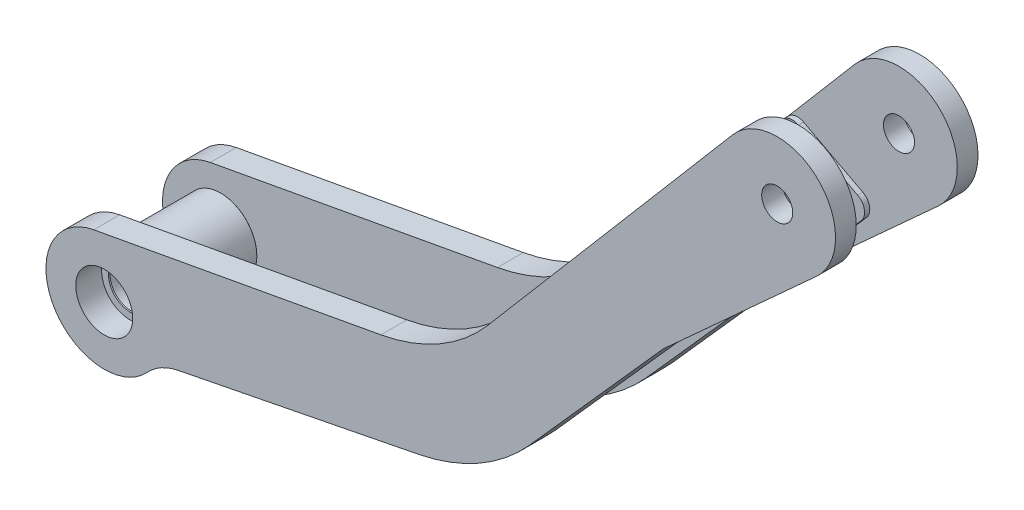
ISO-10303-21;
HEADER;
FILE_DESCRIPTION(('STEP AP214'),'2;1');
FILE_NAME('part.step','',(''),(''),'','','');
FILE_SCHEMA(('AUTOMOTIVE_DESIGN { 1 0 10303 214 1 1 1 1 }'));
ENDSEC;
DATA;
#1=APPLICATION_CONTEXT('core data for automotive mechanical design processes');
#2=APPLICATION_PROTOCOL_DEFINITION('international standard','automotive_design',2000,#1);
#3=PRODUCT_CONTEXT('',#1,'mechanical');
#4=PRODUCT('Part','Part','',(#3));
#5=PRODUCT_RELATED_PRODUCT_CATEGORY('part','',(#4));
#6=PRODUCT_DEFINITION_FORMATION('','',#4);
#7=PRODUCT_DEFINITION_CONTEXT('part definition',#1,'design');
#8=PRODUCT_DEFINITION('design','',#6,#7);
#9=PRODUCT_DEFINITION_SHAPE('','',#8);
#10=(LENGTH_UNIT() NAMED_UNIT(*) SI_UNIT(.MILLI.,.METRE.));
#11=(NAMED_UNIT(*) PLANE_ANGLE_UNIT() SI_UNIT($,.RADIAN.));
#12=(NAMED_UNIT(*) SI_UNIT($,.STERADIAN.) SOLID_ANGLE_UNIT());
#13=UNCERTAINTY_MEASURE_WITH_UNIT(LENGTH_MEASURE(1.E-05),#10,'distance_accuracy_value','');
#14=(GEOMETRIC_REPRESENTATION_CONTEXT(3) GLOBAL_UNCERTAINTY_ASSIGNED_CONTEXT((#13)) GLOBAL_UNIT_ASSIGNED_CONTEXT((#10,
#11,#12)) REPRESENTATION_CONTEXT('',''));
#15=CARTESIAN_POINT('',(0.,0.,0.));
#16=DIRECTION('',(0.,0.,1.));
#17=DIRECTION('',(1.,0.,0.));
#18=AXIS2_PLACEMENT_3D('',#15,#16,#17);
#19=CARTESIAN_POINT('',(-88.2025070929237,-174.327380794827,19.5));
#20=DIRECTION('',(0.,0.,1.));
#21=DIRECTION('',(-0.847525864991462,-0.530754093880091,0.));
#22=AXIS2_PLACEMENT_3D('',#19,#20,#21);
#23=CYLINDRICAL_SURFACE('',#22,22.5);
#24=CARTESIAN_POINT('',(-88.2025070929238,-174.327380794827,27.5));
#25=DIRECTION('',(0.,0.,1.));
#26=DIRECTION('',(-0.847525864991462,-0.530754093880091,0.));
#27=AXIS2_PLACEMENT_3D('',#24,#25,#26);
#28=CIRCLE('',#27,22.5);
#29=CARTESIAN_POINT('',(-92.2551196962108,-152.195360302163,27.5));
#30=VERTEX_POINT('',#29);
#31=CARTESIAN_POINT('',(-71.6705181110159,-189.589862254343,27.5));
#32=VERTEX_POINT('',#31);
#33=EDGE_CURVE('P0_E237',#30,#32,#28,.T.);
#34=ORIENTED_EDGE('',*,*,#33,.F.);
#35=DIRECTION('',(0.,0.,-1.));
#36=VECTOR('',#35,1.);
#37=CARTESIAN_POINT('',(-92.2551196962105,-152.195360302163,323.743723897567));
#38=LINE('',#37,#36);
#39=CARTESIAN_POINT('',(-92.2551196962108,-152.195360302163,17.5));
#40=VERTEX_POINT('',#39);
#41=EDGE_CURVE('P0_E144',#30,#40,#38,.T.);
#42=ORIENTED_EDGE('',*,*,#41,.T.);
#43=CARTESIAN_POINT('',(-88.2025070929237,-174.327380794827,17.5));
#44=DIRECTION('',(0.,0.,-1.));
#45=DIRECTION('',(0.847525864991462,0.530754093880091,0.));
#46=AXIS2_PLACEMENT_3D('',#43,#44,#45);
#47=CIRCLE('',#46,22.5);
#48=CARTESIAN_POINT('',(-71.670518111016,-189.589862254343,17.5));
#49=VERTEX_POINT('',#48);
#50=EDGE_CURVE('P0_E142',#49,#40,#47,.T.);
#51=ORIENTED_EDGE('',*,*,#50,.F.);
#52=DIRECTION('',(0.,0.,1.));
#53=VECTOR('',#52,1.);
#54=CARTESIAN_POINT('',(-71.6705181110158,-189.589862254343,19.5));
#55=LINE('',#54,#53);
#56=EDGE_CURVE('P0_E129',#49,#32,#55,.T.);
#57=ORIENTED_EDGE('',*,*,#56,.T.);
#58=EDGE_LOOP('',(#34,#42,#51,#57));
#59=FACE_BOUND('',#58,.T.);
#60=ADVANCED_FACE('P0_F16',(#59),#23,.T.);
#61=CARTESIAN_POINT('',(171.564170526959,-11.651251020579,19.4999999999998));
#62=DIRECTION('',(0.,0.,1.));
#63=DIRECTION('',(-0.847525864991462,-0.530754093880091,0.));
#64=AXIS2_PLACEMENT_3D('',#61,#62,#63);
#65=CYLINDRICAL_SURFACE('',#64,22.5);
#66=DIRECTION('',(0.,0.,-1.));
#67=VECTOR('',#66,1.);
#68=CARTESIAN_POINT('',(154.436957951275,2.940136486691,323.743723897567));
#69=LINE('',#68,#67);
#70=CARTESIAN_POINT('',(154.436957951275,2.94013648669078,27.4999999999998));
#71=VERTEX_POINT('',#70);
#72=CARTESIAN_POINT('',(154.436957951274,2.94013648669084,19.4999999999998));
#73=VERTEX_POINT('',#72);
#74=EDGE_CURVE('P0_E206',#71,#73,#69,.T.);
#75=ORIENTED_EDGE('',*,*,#74,.F.);
#76=CARTESIAN_POINT('',(171.564170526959,-11.651251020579,27.4999999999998));
#77=DIRECTION('',(0.,0.,1.));
#78=DIRECTION('',(-0.847525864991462,-0.530754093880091,0.));
#79=AXIS2_PLACEMENT_3D('',#76,#77,#78);
#80=CIRCLE('',#79,22.5);
#81=CARTESIAN_POINT('',(186.705297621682,-28.2944559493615,27.4999999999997));
#82=VERTEX_POINT('',#81);
#83=EDGE_CURVE('P0_E242',#82,#71,#80,.T.);
#84=ORIENTED_EDGE('',*,*,#83,.F.);
#85=DIRECTION('',(0.,0.,1.));
#86=VECTOR('',#85,1.);
#87=CARTESIAN_POINT('',(186.705297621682,-28.2944559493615,-60.9365856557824));
#88=LINE('',#87,#86);
#89=CARTESIAN_POINT('',(186.705297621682,-28.2944559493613,19.4999999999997));
#90=VERTEX_POINT('',#89);
#91=EDGE_CURVE('P0_E228',#90,#82,#88,.T.);
#92=ORIENTED_EDGE('',*,*,#91,.F.);
#93=CARTESIAN_POINT('',(171.564170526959,-11.651251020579,19.4999999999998));
#94=DIRECTION('',(0.,0.,1.));
#95=DIRECTION('',(-0.847525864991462,-0.530754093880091,0.));
#96=AXIS2_PLACEMENT_3D('',#93,#94,#95);
#97=CIRCLE('',#96,22.5);
#98=EDGE_CURVE('P0_E238',#90,#73,#97,.T.);
#99=ORIENTED_EDGE('',*,*,#98,.T.);
#100=EDGE_LOOP('',(#75,#84,#92,#99));
#101=FACE_BOUND('',#100,.T.);
#102=ADVANCED_FACE('P0_F299',(#101),#65,.T.);
#103=CARTESIAN_POINT('',(171.564170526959,-11.651251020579,27.4999999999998));
#104=DIRECTION('',(0.,0.,1.));
#105=DIRECTION('',(-0.847525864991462,-0.530754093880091,0.));
#106=AXIS2_PLACEMENT_3D('',#103,#104,#105);
#107=PLANE('',#106);
#108=CARTESIAN_POINT('',(-88.2025070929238,-174.327380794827,27.5));
#109=DIRECTION('',(0.,0.,1.));
#110=DIRECTION('',(-0.847525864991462,-0.530754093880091,0.));
#111=AXIS2_PLACEMENT_3D('',#108,#109,#110);
#112=CIRCLE('',#111,11.);
#113=CARTESIAN_POINT('',(-97.5252916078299,-180.165675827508,27.5));
#114=VERTEX_POINT('',#113);
#115=EDGE_CURVE('P0_E366',#114,#114,#112,.T.);
#116=ORIENTED_EDGE('',*,*,#115,.F.);
#117=EDGE_LOOP('',(#116));
#118=FACE_BOUND('',#117,.T.);
#119=DIRECTION('',(0.983645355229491,0.180116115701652,0.));
#120=VECTOR('',#119,1.);
#121=CARTESIAN_POINT('',(-92.2551196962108,-152.195360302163,27.5));
#122=LINE('',#121,#120);
#123=CARTESIAN_POINT('',(18.574115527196,-131.901327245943,27.4999999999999));
#124=VERTEX_POINT('',#123);
#125=EDGE_CURVE('P0_E212',#30,#124,#122,.T.);
#126=ORIENTED_EDGE('',*,*,#125,.F.);
#127=ORIENTED_EDGE('',*,*,#33,.T.);
#128=CARTESIAN_POINT('',(-55.5059066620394,-204.513177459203,27.4999999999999));
#129=DIRECTION('',(0.,0.,1.));
#130=DIRECTION('',(-0.847525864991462,-0.530754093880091,0.));
#131=AXIS2_PLACEMENT_3D('',#128,#129,#130);
#132=CIRCLE('',#131,22.);
#133=CARTESIAN_POINT('',(-59.7694185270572,-182.930256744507,27.5));
#134=VERTEX_POINT('',#133);
#135=EDGE_CURVE('P0_E135',#32,#134,#132,.F.);
#136=ORIENTED_EDGE('',*,*,#135,.T.);
#137=DIRECTION('',(0.981041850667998,0.193795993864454,0.));
#138=VECTOR('',#137,1.);
#139=CARTESIAN_POINT('',(58.6583262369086,-159.53592093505,27.4999999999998));
#140=LINE('',#139,#138);
#141=CARTESIAN_POINT('',(33.0970075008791,-164.585329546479,27.4999999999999));
#142=VERTEX_POINT('',#141);
#143=EDGE_CURVE('P0_E244',#134,#142,#140,.T.);
#144=ORIENTED_EDGE('',*,*,#143,.T.);
#145=CARTESIAN_POINT('',(18.0778179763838,-88.554586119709,27.4999999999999));
#146=DIRECTION('',(0.,0.,1.));
#147=DIRECTION('',(-0.847525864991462,-0.530754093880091,0.));
#148=AXIS2_PLACEMENT_3D('',#145,#146,#147);
#149=CIRCLE('',#148,77.5);
#150=CARTESIAN_POINT('',(75.9777092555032,-140.07014289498,27.4999999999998));
#151=VERTEX_POINT('',#150);
#152=EDGE_CURVE('P0_E253',#142,#151,#149,.T.);
#153=ORIENTED_EDGE('',*,*,#152,.T.);
#154=DIRECTION('',(0.664716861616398,0.747095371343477,0.));
#155=VECTOR('',#154,1.);
#156=CARTESIAN_POINT('',(170.251544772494,-34.1129298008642,27.4999999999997));
#157=LINE('',#156,#155);
#158=CARTESIAN_POINT('',(127.5294578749,-82.129574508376,27.4999999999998));
#159=VERTEX_POINT('',#158);
#160=EDGE_CURVE('P0_E246',#151,#159,#157,.T.);
#161=ORIENTED_EDGE('',*,*,#160,.T.);
#162=DIRECTION('',(0.739697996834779,0.672938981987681,0.));
#163=VECTOR('',#162,1.);
#164=CARTESIAN_POINT('',(186.705297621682,-28.2944559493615,27.4999999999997));
#165=LINE('',#164,#163);
#166=EDGE_CURVE('P0_E217',#159,#82,#165,.T.);
#167=ORIENTED_EDGE('',*,*,#166,.T.);
#168=ORIENTED_EDGE('',*,*,#83,.T.);
#169=DIRECTION('',(0.648506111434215,0.761209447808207,0.));
#170=VECTOR('',#169,1.);
#171=CARTESIAN_POINT('',(154.436957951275,2.94013648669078,27.4999999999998));
#172=LINE('',#171,#170);
#173=CARTESIAN_POINT('',(59.8317421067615,-108.106440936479,27.4999999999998));
#174=VERTEX_POINT('',#173);
#175=EDGE_CURVE('P0_E204',#174,#71,#172,.T.);
#176=ORIENTED_EDGE('',*,*,#175,.F.);
#177=CARTESIAN_POINT('',(5.78587131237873,-62.0625070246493,27.5));
#178=DIRECTION('',(0.,0.,1.));
#179=DIRECTION('',(-0.847525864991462,-0.530754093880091,0.));
#180=AXIS2_PLACEMENT_3D('',#177,#178,#179);
#181=CIRCLE('',#180,71.);
#182=EDGE_CURVE('P0_E208',#124,#174,#181,.T.);
#183=ORIENTED_EDGE('',*,*,#182,.F.);
#184=EDGE_LOOP('',(#126,#127,#136,#144,#153,#161,#167,#168,#176,#183));
#185=FACE_BOUND('',#184,.T.);
#186=CARTESIAN_POINT('',(171.564170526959,-11.651251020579,27.4999999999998));
#187=DIRECTION('',(0.,0.,1.));
#188=DIRECTION('',(-0.847525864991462,-0.530754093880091,0.));
#189=AXIS2_PLACEMENT_3D('',#186,#187,#188);
#190=CIRCLE('',#189,6.);
#191=CARTESIAN_POINT('',(166.47901533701,-14.8357755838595,27.4999999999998));
#192=VERTEX_POINT('',#191);
#193=EDGE_CURVE('P0_E224',#192,#192,#190,.T.);
#194=ORIENTED_EDGE('',*,*,#193,.F.);
#195=EDGE_LOOP('',(#194));
#196=FACE_BOUND('',#195,.T.);
#197=ADVANCED_FACE('P0_F279',(#118,#185,#196),#107,.T.);
#198=CARTESIAN_POINT('',(170.251544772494,-34.112929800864,19.4999999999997));
#199=DIRECTION('',(0.747095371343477,-0.664716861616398,0.));
#200=DIRECTION('',(0.664716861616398,0.747095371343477,0.));
#201=AXIS2_PLACEMENT_3D('',#198,#199,#200);
#202=PLANE('',#201);
#203=DIRECTION('',(-0.664716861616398,-0.747095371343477,0.));
#204=VECTOR('',#203,1.);
#205=CARTESIAN_POINT('',(127.5294578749,-82.1295745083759,17.4999999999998));
#206=LINE('',#205,#204);
#207=CARTESIAN_POINT('',(127.494171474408,-82.1692339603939,17.4999999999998));
#208=VERTEX_POINT('',#207);
#209=CARTESIAN_POINT('',(75.9777092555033,-140.07014289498,17.4999999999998));
#210=VERTEX_POINT('',#209);
#211=EDGE_CURVE('P0_E177',#208,#210,#206,.T.);
#212=ORIENTED_EDGE('',*,*,#211,.F.);
#213=DIRECTION('',(0.,0.,1.));
#214=VECTOR('',#213,1.);
#215=CARTESIAN_POINT('',(127.494171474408,-82.1692339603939,19.4999999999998));
#216=LINE('',#215,#214);
#217=CARTESIAN_POINT('',(127.494171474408,-82.1692339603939,19.4999999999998));
#218=VERTEX_POINT('',#217);
#219=EDGE_CURVE('P0_E261',#208,#218,#216,.T.);
#220=ORIENTED_EDGE('',*,*,#219,.T.);
#221=DIRECTION('',(0.664716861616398,0.747095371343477,0.));
#222=VECTOR('',#221,1.);
#223=CARTESIAN_POINT('',(181.986150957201,-20.9240512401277,19.4999999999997));
#224=LINE('',#223,#222);
#225=CARTESIAN_POINT('',(127.5294578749,-82.1295745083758,19.4999999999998));
#226=VERTEX_POINT('',#225);
#227=EDGE_CURVE('P0_E259',#218,#226,#224,.T.);
#228=ORIENTED_EDGE('',*,*,#227,.T.);
#229=DIRECTION('',(0.,0.,1.));
#230=VECTOR('',#229,1.);
#231=CARTESIAN_POINT('',(127.5294578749,-82.1295745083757,-60.9365856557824));
#232=LINE('',#231,#230);
#233=EDGE_CURVE('P0_E225',#226,#159,#232,.T.);
#234=ORIENTED_EDGE('',*,*,#233,.T.);
#235=ORIENTED_EDGE('',*,*,#160,.F.);
#236=DIRECTION('',(0.,0.,1.));
#237=VECTOR('',#236,1.);
#238=CARTESIAN_POINT('',(75.9777092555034,-140.07014289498,19.4999999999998));
#239=LINE('',#238,#237);
#240=EDGE_CURVE('P0_E139',#151,#210,#239,.F.);
#241=ORIENTED_EDGE('',*,*,#240,.T.);
#242=EDGE_LOOP('',(#212,#220,#228,#234,#235,#241));
#243=FACE_BOUND('',#242,.T.);
#244=ADVANCED_FACE('P0_F269',(#243),#202,.T.);
#245=CARTESIAN_POINT('',(58.6583262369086,-159.53592093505,19.4999999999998));
#246=DIRECTION('',(0.193795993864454,-0.981041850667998,0.));
#247=DIRECTION('',(0.981041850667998,0.193795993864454,0.));
#248=AXIS2_PLACEMENT_3D('',#245,#246,#247);
#249=PLANE('',#248);
#250=ORIENTED_EDGE('',*,*,#143,.F.);
#251=DIRECTION('',(0.,0.,-1.));
#252=VECTOR('',#251,1.);
#253=CARTESIAN_POINT('',(-59.7694185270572,-182.930256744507,19.5));
#254=LINE('',#253,#252);
#255=CARTESIAN_POINT('',(-59.7694185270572,-182.930256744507,17.5));
#256=VERTEX_POINT('',#255);
#257=EDGE_CURVE('P0_E138',#134,#256,#254,.T.);
#258=ORIENTED_EDGE('',*,*,#257,.T.);
#259=DIRECTION('',(-0.981041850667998,-0.193795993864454,0.));
#260=VECTOR('',#259,1.);
#261=CARTESIAN_POINT('',(33.097007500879,-164.585329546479,17.4999999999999));
#262=LINE('',#261,#260);
#263=CARTESIAN_POINT('',(33.097007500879,-164.585329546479,17.4999999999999));
#264=VERTEX_POINT('',#263);
#265=EDGE_CURVE('P0_E154',#264,#256,#262,.T.);
#266=ORIENTED_EDGE('',*,*,#265,.F.);
#267=DIRECTION('',(0.,0.,1.));
#268=VECTOR('',#267,1.);
#269=CARTESIAN_POINT('',(33.0970075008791,-164.585329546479,19.4999999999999));
#270=LINE('',#269,#268);
#271=EDGE_CURVE('P0_E241',#264,#142,#270,.T.);
#272=ORIENTED_EDGE('',*,*,#271,.T.);
#273=EDGE_LOOP('',(#250,#258,#266,#272));
#274=FACE_BOUND('',#273,.T.);
#275=ADVANCED_FACE('P0_F287',(#274),#249,.T.);
#276=CARTESIAN_POINT('',(171.564170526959,-11.651251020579,19.4999999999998));
#277=DIRECTION('',(0.,0.,1.));
#278=DIRECTION('',(-0.847525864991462,-0.530754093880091,0.));
#279=AXIS2_PLACEMENT_3D('',#276,#277,#278);
#280=PLANE('',#279);
#281=DIRECTION('',(-0.656747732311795,-0.75411034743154,0.));
#282=VECTOR('',#281,1.);
#283=CARTESIAN_POINT('',(159.062170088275,-45.9221490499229,19.4999999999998));
#284=LINE('',#283,#282);
#285=CARTESIAN_POINT('',(159.062170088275,-45.9221490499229,19.4999999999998));
#286=VERTEX_POINT('',#285);
#287=CARTESIAN_POINT('',(127.564321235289,-82.0895426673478,19.4999999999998));
#288=VERTEX_POINT('',#287);
#289=EDGE_CURVE('P0_E155',#286,#288,#284,.T.);
#290=ORIENTED_EDGE('',*,*,#289,.F.);
#291=CARTESIAN_POINT('',(155.291618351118,-42.638410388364,19.4999999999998));
#292=DIRECTION('',(0.,0.,-1.));
#293=DIRECTION('',(0.847525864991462,0.530754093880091,0.));
#294=AXIS2_PLACEMENT_3D('',#291,#292,#293);
#295=CIRCLE('',#294,5.);
#296=CARTESIAN_POINT('',(157.616268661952,-38.2116733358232,19.4999999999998));
#297=VERTEX_POINT('',#296);
#298=EDGE_CURVE('P0_E157',#297,#286,#295,.T.);
#299=ORIENTED_EDGE('',*,*,#298,.F.);
#300=DIRECTION('',(0.885347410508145,-0.464930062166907,0.));
#301=VECTOR('',#300,1.);
#302=CARTESIAN_POINT('',(157.616268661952,-38.2116733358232,19.4999999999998));
#303=LINE('',#302,#301);
#304=CARTESIAN_POINT('',(134.736124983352,-26.1964276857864,19.4999999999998));
#305=VERTEX_POINT('',#304);
#306=EDGE_CURVE('P0_E186',#305,#297,#303,.T.);
#307=ORIENTED_EDGE('',*,*,#306,.F.);
#308=CARTESIAN_POINT('',(132.411474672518,-30.6231647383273,19.4999999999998));
#309=DIRECTION('',(0.,0.,-1.));
#310=DIRECTION('',(0.847525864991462,0.530754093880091,0.));
#311=AXIS2_PLACEMENT_3D('',#308,#309,#310);
#312=CIRCLE('',#311,5.);
#313=CARTESIAN_POINT('',(128.605427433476,-27.380634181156,19.4999999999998));
#314=VERTEX_POINT('',#313);
#315=EDGE_CURVE('P0_E183',#314,#305,#312,.T.);
#316=ORIENTED_EDGE('',*,*,#315,.F.);
#317=DIRECTION('',(0.648506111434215,0.761209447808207,0.));
#318=VECTOR('',#317,1.);
#319=CARTESIAN_POINT('',(154.436957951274,2.94013648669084,19.4999999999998));
#320=LINE('',#319,#318);
#321=EDGE_CURVE('P0_E202',#314,#73,#320,.T.);
#322=ORIENTED_EDGE('',*,*,#321,.T.);
#323=ORIENTED_EDGE('',*,*,#98,.F.);
#324=DIRECTION('',(-0.739697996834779,-0.672938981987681,0.));
#325=VECTOR('',#324,1.);
#326=CARTESIAN_POINT('',(186.705297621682,-28.2944559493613,19.4999999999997));
#327=LINE('',#326,#325);
#328=EDGE_CURVE('P0_E221',#90,#226,#327,.T.);
#329=ORIENTED_EDGE('',*,*,#328,.T.);
#330=ORIENTED_EDGE('',*,*,#227,.F.);
#331=CARTESIAN_POINT('',(120.023217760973,-75.5220653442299,19.4999999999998));
#332=DIRECTION('',(0.,0.,1.));
#333=DIRECTION('',(-0.847525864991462,-0.530754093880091,0.));
#334=AXIS2_PLACEMENT_3D('',#331,#332,#333);
#335=CIRCLE('',#334,10.);
#336=EDGE_CURVE('P0_E11',#218,#288,#335,.T.);
#337=ORIENTED_EDGE('',*,*,#336,.T.);
#338=EDGE_LOOP('',(#290,#299,#307,#316,#322,#323,#329,#330,#337));
#339=FACE_BOUND('',#338,.T.);
#340=CARTESIAN_POINT('',(171.564170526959,-11.651251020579,19.4999999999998));
#341=DIRECTION('',(0.,0.,1.));
#342=DIRECTION('',(-0.847525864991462,-0.530754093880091,0.));
#343=AXIS2_PLACEMENT_3D('',#340,#341,#342);
#344=CIRCLE('',#343,6.);
#345=CARTESIAN_POINT('',(166.47901533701,-14.8357755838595,19.4999999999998));
#346=VERTEX_POINT('',#345);
#347=EDGE_CURVE('P0_E234',#346,#346,#344,.T.);
#348=ORIENTED_EDGE('',*,*,#347,.T.);
#349=EDGE_LOOP('',(#348));
#350=FACE_BOUND('',#349,.T.);
#351=ADVANCED_FACE('P0_F273',(#339,#350),#280,.F.);
#352=CARTESIAN_POINT('',(18.0778179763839,-88.5545861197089,19.4999999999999));
#353=DIRECTION('',(0.,0.,1.));
#354=DIRECTION('',(-0.847525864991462,-0.530754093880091,0.));
#355=AXIS2_PLACEMENT_3D('',#352,#353,#354);
#356=CYLINDRICAL_SURFACE('',#355,77.5);
#357=ORIENTED_EDGE('',*,*,#271,.F.);
#358=CARTESIAN_POINT('',(18.0778179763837,-88.5545861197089,17.4999999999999));
#359=DIRECTION('',(0.,0.,-1.));
#360=DIRECTION('',(0.847525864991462,0.530754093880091,0.));
#361=AXIS2_PLACEMENT_3D('',#358,#359,#360);
#362=CIRCLE('',#361,77.5);
#363=EDGE_CURVE('P0_E179',#210,#264,#362,.T.);
#364=ORIENTED_EDGE('',*,*,#363,.F.);
#365=ORIENTED_EDGE('',*,*,#240,.F.);
#366=ORIENTED_EDGE('',*,*,#152,.F.);
#367=EDGE_LOOP('',(#357,#364,#365,#366));
#368=FACE_BOUND('',#367,.T.);
#369=ADVANCED_FACE('P0_F285',(#368),#356,.T.);
#370=CARTESIAN_POINT('',(171.564170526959,-11.651251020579,27.4999999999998));
#371=DIRECTION('',(0.,0.,1.));
#372=DIRECTION('',(-0.847525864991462,-0.530754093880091,0.));
#373=AXIS2_PLACEMENT_3D('',#370,#371,#372);
#374=CYLINDRICAL_SURFACE('',#373,6.);
#375=ORIENTED_EDGE('',*,*,#347,.F.);
#376=EDGE_LOOP('',(#375));
#377=FACE_BOUND('',#376,.T.);
#378=ORIENTED_EDGE('',*,*,#193,.T.);
#379=EDGE_LOOP('',(#378));
#380=FACE_BOUND('',#379,.T.);
#381=ADVANCED_FACE('P0_F310',(#377,#380),#374,.F.);
#382=CARTESIAN_POINT('',(-55.5059066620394,-204.513177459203,19.4999999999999));
#383=DIRECTION('',(0.,0.,1.));
#384=DIRECTION('',(-0.847525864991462,-0.530754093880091,0.));
#385=AXIS2_PLACEMENT_3D('',#382,#383,#384);
#386=CYLINDRICAL_SURFACE('',#385,22.);
#387=ORIENTED_EDGE('',*,*,#56,.F.);
#388=CARTESIAN_POINT('',(-55.5059066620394,-204.513177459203,17.4999999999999));
#389=DIRECTION('',(0.,0.,1.));
#390=DIRECTION('',(0.847525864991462,0.530754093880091,0.));
#391=AXIS2_PLACEMENT_3D('',#388,#389,#390);
#392=CIRCLE('',#391,22.);
#393=EDGE_CURVE('P0_E134',#256,#49,#392,.T.);
#394=ORIENTED_EDGE('',*,*,#393,.F.);
#395=ORIENTED_EDGE('',*,*,#257,.F.);
#396=ORIENTED_EDGE('',*,*,#135,.F.);
#397=EDGE_LOOP('',(#387,#394,#395,#396));
#398=FACE_BOUND('',#397,.T.);
#399=ADVANCED_FACE('P0_F131',(#398),#386,.F.);
#400=CARTESIAN_POINT('',(186.705297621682,-28.2944559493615,-60.9365856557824));
#401=DIRECTION('',(0.672938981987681,-0.739697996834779,0.));
#402=DIRECTION('',(0.739697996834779,0.672938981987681,0.));
#403=AXIS2_PLACEMENT_3D('',#400,#401,#402);
#404=PLANE('',#403);
#405=ORIENTED_EDGE('',*,*,#328,.F.);
#406=ORIENTED_EDGE('',*,*,#91,.T.);
#407=ORIENTED_EDGE('',*,*,#166,.F.);
#408=ORIENTED_EDGE('',*,*,#233,.F.);
#409=EDGE_LOOP('',(#405,#406,#407,#408));
#410=FACE_BOUND('',#409,.T.);
#411=ADVANCED_FACE('P0_F312',(#410),#404,.T.);
#412=CARTESIAN_POINT('',(-92.2551196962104,-152.195360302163,323.743723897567));
#413=DIRECTION('',(-0.180116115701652,0.983645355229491,0.));
#414=DIRECTION('',(-0.983645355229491,-0.180116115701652,0.));
#415=AXIS2_PLACEMENT_3D('',#412,#413,#414);
#416=PLANE('',#415);
#417=ORIENTED_EDGE('',*,*,#41,.F.);
#418=ORIENTED_EDGE('',*,*,#125,.T.);
#419=DIRECTION('',(0.,0.,-1.));
#420=VECTOR('',#419,1.);
#421=CARTESIAN_POINT('',(18.5741155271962,-131.901327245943,323.743723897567));
#422=LINE('',#421,#420);
#423=CARTESIAN_POINT('',(18.5741155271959,-131.901327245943,17.4999999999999));
#424=VERTEX_POINT('',#423);
#425=EDGE_CURVE('P0_E211',#124,#424,#422,.T.);
#426=ORIENTED_EDGE('',*,*,#425,.T.);
#427=DIRECTION('',(0.98364535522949,0.180116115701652,0.));
#428=VECTOR('',#427,1.);
#429=CARTESIAN_POINT('',(-92.2551196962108,-152.195360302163,17.5));
#430=LINE('',#429,#428);
#431=EDGE_CURVE('P0_E148',#40,#424,#430,.T.);
#432=ORIENTED_EDGE('',*,*,#431,.F.);
#433=EDGE_LOOP('',(#417,#418,#426,#432));
#434=FACE_BOUND('',#433,.T.);
#435=ADVANCED_FACE('P0_F317',(#434),#416,.T.);
#436=CARTESIAN_POINT('',(5.78587131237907,-62.0625070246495,323.743723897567));
#437=DIRECTION('',(0.,0.,-1.));
#438=DIRECTION('',(0.847525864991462,0.530754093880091,0.));
#439=AXIS2_PLACEMENT_3D('',#436,#437,#438);
#440=CYLINDRICAL_SURFACE('',#439,71.);
#441=ORIENTED_EDGE('',*,*,#425,.F.);
#442=ORIENTED_EDGE('',*,*,#182,.T.);
#443=DIRECTION('',(0.,0.,-1.));
#444=VECTOR('',#443,1.);
#445=CARTESIAN_POINT('',(59.8317421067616,-108.106440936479,323.743723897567));
#446=LINE('',#445,#444);
#447=CARTESIAN_POINT('',(59.8317421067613,-108.106440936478,17.4999999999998));
#448=VERTEX_POINT('',#447);
#449=EDGE_CURVE('P0_E207',#174,#448,#446,.T.);
#450=ORIENTED_EDGE('',*,*,#449,.T.);
#451=CARTESIAN_POINT('',(5.78587131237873,-62.0625070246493,17.5));
#452=DIRECTION('',(0.,0.,1.));
#453=DIRECTION('',(0.847525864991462,0.530754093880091,0.));
#454=AXIS2_PLACEMENT_3D('',#451,#452,#453);
#455=CIRCLE('',#454,71.);
#456=EDGE_CURVE('P0_E164',#424,#448,#455,.T.);
#457=ORIENTED_EDGE('',*,*,#456,.F.);
#458=EDGE_LOOP('',(#441,#442,#450,#457));
#459=FACE_BOUND('',#458,.T.);
#460=ADVANCED_FACE('P0_F328',(#459),#440,.F.);
#461=CARTESIAN_POINT('',(154.436957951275,2.940136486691,323.743723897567));
#462=DIRECTION('',(-0.761209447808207,0.648506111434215,0.));
#463=DIRECTION('',(-0.648506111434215,-0.761209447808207,0.));
#464=AXIS2_PLACEMENT_3D('',#461,#462,#463);
#465=PLANE('',#464);
#466=ORIENTED_EDGE('',*,*,#449,.F.);
#467=ORIENTED_EDGE('',*,*,#175,.T.);
#468=ORIENTED_EDGE('',*,*,#74,.T.);
#469=ORIENTED_EDGE('',*,*,#321,.F.);
#470=DIRECTION('',(0.,0.,1.));
#471=VECTOR('',#470,1.);
#472=CARTESIAN_POINT('',(128.605427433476,-27.380634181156,17.4999999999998));
#473=LINE('',#472,#471);
#474=CARTESIAN_POINT('',(128.605427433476,-27.380634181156,17.4999999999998));
#475=VERTEX_POINT('',#474);
#476=EDGE_CURVE('P0_E199',#475,#314,#473,.T.);
#477=ORIENTED_EDGE('',*,*,#476,.F.);
#478=DIRECTION('',(0.648506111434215,0.761209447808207,0.));
#479=VECTOR('',#478,1.);
#480=CARTESIAN_POINT('',(128.605427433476,-27.380634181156,17.4999999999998));
#481=LINE('',#480,#479);
#482=EDGE_CURVE('P0_E167',#448,#475,#481,.T.);
#483=ORIENTED_EDGE('',*,*,#482,.F.);
#484=EDGE_LOOP('',(#466,#467,#468,#469,#477,#483));
#485=FACE_BOUND('',#484,.T.);
#486=ADVANCED_FACE('P0_F332',(#485),#465,.T.);
#487=CARTESIAN_POINT('',(132.411474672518,-30.6231647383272,17.4999999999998));
#488=DIRECTION('',(0.,0.,1.));
#489=DIRECTION('',(-0.847525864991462,-0.530754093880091,0.));
#490=AXIS2_PLACEMENT_3D('',#487,#488,#489);
#491=CYLINDRICAL_SURFACE('',#490,5.);
#492=ORIENTED_EDGE('',*,*,#315,.T.);
#493=DIRECTION('',(0.,0.,1.));
#494=VECTOR('',#493,1.);
#495=CARTESIAN_POINT('',(134.736124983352,-26.1964276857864,17.4999999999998));
#496=LINE('',#495,#494);
#497=CARTESIAN_POINT('',(134.736124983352,-26.1964276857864,17.4999999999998));
#498=VERTEX_POINT('',#497);
#499=EDGE_CURVE('P0_E196',#498,#305,#496,.T.);
#500=ORIENTED_EDGE('',*,*,#499,.F.);
#501=CARTESIAN_POINT('',(132.411474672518,-30.6231647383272,17.4999999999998));
#502=DIRECTION('',(0.,0.,-1.));
#503=DIRECTION('',(0.847525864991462,0.530754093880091,0.));
#504=AXIS2_PLACEMENT_3D('',#501,#502,#503);
#505=CIRCLE('',#504,5.);
#506=EDGE_CURVE('P0_E169',#475,#498,#505,.T.);
#507=ORIENTED_EDGE('',*,*,#506,.F.);
#508=ORIENTED_EDGE('',*,*,#476,.T.);
#509=EDGE_LOOP('',(#492,#500,#507,#508));
#510=FACE_BOUND('',#509,.T.);
#511=ADVANCED_FACE('P0_F336',(#510),#491,.T.);
#512=CARTESIAN_POINT('',(157.616268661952,-38.2116733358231,17.4999999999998));
#513=DIRECTION('',(-0.464930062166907,-0.885347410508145,0.));
#514=DIRECTION('',(0.885347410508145,-0.464930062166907,0.));
#515=AXIS2_PLACEMENT_3D('',#512,#513,#514);
#516=PLANE('',#515);
#517=ORIENTED_EDGE('',*,*,#306,.T.);
#518=DIRECTION('',(0.,0.,1.));
#519=VECTOR('',#518,1.);
#520=CARTESIAN_POINT('',(157.616268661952,-38.2116733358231,17.4999999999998));
#521=LINE('',#520,#519);
#522=CARTESIAN_POINT('',(157.616268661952,-38.2116733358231,17.4999999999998));
#523=VERTEX_POINT('',#522);
#524=EDGE_CURVE('P0_E193',#523,#297,#521,.T.);
#525=ORIENTED_EDGE('',*,*,#524,.F.);
#526=DIRECTION('',(0.885347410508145,-0.464930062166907,0.));
#527=VECTOR('',#526,1.);
#528=CARTESIAN_POINT('',(157.616268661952,-38.2116733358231,17.4999999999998));
#529=LINE('',#528,#527);
#530=EDGE_CURVE('P0_E171',#498,#523,#529,.T.);
#531=ORIENTED_EDGE('',*,*,#530,.F.);
#532=ORIENTED_EDGE('',*,*,#499,.T.);
#533=EDGE_LOOP('',(#517,#525,#531,#532));
#534=FACE_BOUND('',#533,.T.);
#535=ADVANCED_FACE('P0_F340',(#534),#516,.F.);
#536=CARTESIAN_POINT('',(155.291618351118,-42.638410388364,17.4999999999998));
#537=DIRECTION('',(0.,0.,1.));
#538=DIRECTION('',(-0.847525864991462,-0.530754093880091,0.));
#539=AXIS2_PLACEMENT_3D('',#536,#537,#538);
#540=CYLINDRICAL_SURFACE('',#539,5.);
#541=ORIENTED_EDGE('',*,*,#298,.T.);
#542=DIRECTION('',(0.,0.,1.));
#543=VECTOR('',#542,1.);
#544=CARTESIAN_POINT('',(159.062170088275,-45.9221490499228,17.4999999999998));
#545=LINE('',#544,#543);
#546=CARTESIAN_POINT('',(159.062170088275,-45.9221490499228,17.4999999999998));
#547=VERTEX_POINT('',#546);
#548=EDGE_CURVE('P0_E182',#547,#286,#545,.T.);
#549=ORIENTED_EDGE('',*,*,#548,.F.);
#550=CARTESIAN_POINT('',(155.291618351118,-42.638410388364,17.4999999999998));
#551=DIRECTION('',(0.,0.,-1.));
#552=DIRECTION('',(0.847525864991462,0.530754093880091,0.));
#553=AXIS2_PLACEMENT_3D('',#550,#551,#552);
#554=CIRCLE('',#553,5.);
#555=EDGE_CURVE('P0_E173',#523,#547,#554,.T.);
#556=ORIENTED_EDGE('',*,*,#555,.F.);
#557=ORIENTED_EDGE('',*,*,#524,.T.);
#558=EDGE_LOOP('',(#541,#549,#556,#557));
#559=FACE_BOUND('',#558,.T.);
#560=ADVANCED_FACE('P0_F344',(#559),#540,.T.);
#561=CARTESIAN_POINT('',(159.062170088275,-45.9221490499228,17.4999999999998));
#562=DIRECTION('',(-0.754110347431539,0.656747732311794,0.));
#563=DIRECTION('',(-0.656747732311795,-0.75411034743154,0.));
#564=AXIS2_PLACEMENT_3D('',#561,#562,#563);
#565=PLANE('',#564);
#566=ORIENTED_EDGE('',*,*,#289,.T.);
#567=DIRECTION('',(0.,0.,1.));
#568=VECTOR('',#567,1.);
#569=CARTESIAN_POINT('',(127.564321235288,-82.0895426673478,17.4999999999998));
#570=LINE('',#569,#568);
#571=CARTESIAN_POINT('',(127.564321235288,-82.0895426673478,17.4999999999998));
#572=VERTEX_POINT('',#571);
#573=EDGE_CURVE('P0_E31',#288,#572,#570,.F.);
#574=ORIENTED_EDGE('',*,*,#573,.T.);
#575=DIRECTION('',(-0.656747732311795,-0.75411034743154,0.));
#576=VECTOR('',#575,1.);
#577=CARTESIAN_POINT('',(159.062170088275,-45.9221490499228,17.4999999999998));
#578=LINE('',#577,#576);
#579=EDGE_CURVE('P0_E175',#547,#572,#578,.T.);
#580=ORIENTED_EDGE('',*,*,#579,.F.);
#581=ORIENTED_EDGE('',*,*,#548,.T.);
#582=EDGE_LOOP('',(#566,#574,#580,#581));
#583=FACE_BOUND('',#582,.T.);
#584=ADVANCED_FACE('P0_F348',(#583),#565,.F.);
#585=CARTESIAN_POINT('',(-55.5059066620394,-204.513177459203,17.4999999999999));
#586=DIRECTION('',(0.,0.,-1.));
#587=DIRECTION('',(0.847525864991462,0.530754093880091,0.));
#588=AXIS2_PLACEMENT_3D('',#585,#586,#587);
#589=PLANE('',#588);
#590=CARTESIAN_POINT('',(-88.2025070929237,-174.327380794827,17.5));
#591=DIRECTION('',(0.,0.,1.));
#592=DIRECTION('',(-0.847525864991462,-0.530754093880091,0.));
#593=AXIS2_PLACEMENT_3D('',#590,#591,#592);
#594=CIRCLE('',#593,11.);
#595=CARTESIAN_POINT('',(-97.5252916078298,-180.165675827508,17.5));
#596=VERTEX_POINT('',#595);
#597=EDGE_CURVE('P0_E160',#596,#596,#594,.T.);
#598=ORIENTED_EDGE('',*,*,#597,.T.);
#599=EDGE_LOOP('',(#598));
#600=FACE_BOUND('',#599,.T.);
#601=ORIENTED_EDGE('',*,*,#579,.T.);
#602=CARTESIAN_POINT('',(120.023217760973,-75.5220653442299,17.4999999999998));
#603=DIRECTION('',(0.,0.,-1.));
#604=DIRECTION('',(0.847525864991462,0.530754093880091,0.));
#605=AXIS2_PLACEMENT_3D('',#602,#603,#604);
#606=CIRCLE('',#605,10.);
#607=EDGE_CURVE('P0_E24',#572,#208,#606,.T.);
#608=ORIENTED_EDGE('',*,*,#607,.T.);
#609=ORIENTED_EDGE('',*,*,#211,.T.);
#610=ORIENTED_EDGE('',*,*,#363,.T.);
#611=ORIENTED_EDGE('',*,*,#265,.T.);
#612=ORIENTED_EDGE('',*,*,#393,.T.);
#613=ORIENTED_EDGE('',*,*,#50,.T.);
#614=ORIENTED_EDGE('',*,*,#431,.T.);
#615=ORIENTED_EDGE('',*,*,#456,.T.);
#616=ORIENTED_EDGE('',*,*,#482,.T.);
#617=ORIENTED_EDGE('',*,*,#506,.T.);
#618=ORIENTED_EDGE('',*,*,#530,.T.);
#619=ORIENTED_EDGE('',*,*,#555,.T.);
#620=EDGE_LOOP('',(#601,#608,#609,#610,#611,#612,#613,#614,#615,#616,#617,#618,#619));
#621=FACE_BOUND('',#620,.T.);
#622=ADVANCED_FACE('P0_F151',(#600,#621),#589,.T.);
#623=CARTESIAN_POINT('',(120.023217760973,-75.5220653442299,19.4999999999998));
#624=DIRECTION('',(0.,0.,-1.));
#625=DIRECTION('',(0.847525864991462,0.530754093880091,0.));
#626=AXIS2_PLACEMENT_3D('',#623,#624,#625);
#627=CYLINDRICAL_SURFACE('',#626,10.);
#628=ORIENTED_EDGE('',*,*,#607,.F.);
#629=ORIENTED_EDGE('',*,*,#573,.F.);
#630=ORIENTED_EDGE('',*,*,#336,.F.);
#631=ORIENTED_EDGE('',*,*,#219,.F.);
#632=EDGE_LOOP('',(#628,#629,#630,#631));
#633=FACE_BOUND('',#632,.T.);
#634=ADVANCED_FACE('P0_F18',(#633),#627,.T.);
#635=CARTESIAN_POINT('',(-88.2025070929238,-174.327380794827,27.5));
#636=DIRECTION('',(0.,0.,1.));
#637=DIRECTION('',(-0.847525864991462,-0.530754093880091,0.));
#638=AXIS2_PLACEMENT_3D('',#635,#636,#637);
#639=CYLINDRICAL_SURFACE('',#638,11.);
#640=ORIENTED_EDGE('',*,*,#597,.F.);
#641=EDGE_LOOP('',(#640));
#642=FACE_BOUND('',#641,.T.);
#643=ORIENTED_EDGE('',*,*,#115,.T.);
#644=EDGE_LOOP('',(#643));
#645=FACE_BOUND('',#644,.T.);
#646=ADVANCED_FACE('P0_F355',(#642,#645),#639,.F.);
#647=CLOSED_SHELL('',(#60,#102,#197,#244,#275,#351,#369,#381,#399,#411,#435,#460,#486,#511,#535,
#560,#584,#622,#634,#646));
#648=MANIFOLD_SOLID_BREP('P0_B1',#647);
#649=CARTESIAN_POINT('',(-88.2025070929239,-174.327380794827,-19.5));
#650=DIRECTION('',(0.,0.,-1.));
#651=DIRECTION('',(-0.847525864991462,-0.530754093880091,0.));
#652=AXIS2_PLACEMENT_3D('',#649,#650,#651);
#653=CYLINDRICAL_SURFACE('',#652,22.5);
#654=CARTESIAN_POINT('',(-88.2025070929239,-174.327380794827,-27.5));
#655=DIRECTION('',(0.,0.,1.));
#656=DIRECTION('',(-0.847525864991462,-0.530754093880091,0.));
#657=AXIS2_PLACEMENT_3D('',#654,#655,#656);
#658=CIRCLE('',#657,22.5);
#659=CARTESIAN_POINT('',(-92.255119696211,-152.195360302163,-27.5));
#660=VERTEX_POINT('',#659);
#661=CARTESIAN_POINT('',(-71.6705181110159,-189.589862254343,-27.5));
#662=VERTEX_POINT('',#661);
#663=EDGE_CURVE('P1_E150',#660,#662,#658,.T.);
#664=ORIENTED_EDGE('',*,*,#663,.T.);
#665=DIRECTION('',(0.,0.,-1.));
#666=VECTOR('',#665,1.);
#667=CARTESIAN_POINT('',(-71.6705181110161,-189.589862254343,-19.5));
#668=LINE('',#667,#666);
#669=CARTESIAN_POINT('',(-71.6705181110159,-189.589862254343,-17.5));
#670=VERTEX_POINT('',#669);
#671=EDGE_CURVE('P1_E133',#670,#662,#668,.T.);
#672=ORIENTED_EDGE('',*,*,#671,.F.);
#673=CARTESIAN_POINT('',(-88.2025070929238,-174.327380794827,-17.5));
#674=DIRECTION('',(0.,0.,-1.));
#675=DIRECTION('',(0.847525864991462,0.530754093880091,0.));
#676=AXIS2_PLACEMENT_3D('',#673,#674,#675);
#677=CIRCLE('',#676,22.5);
#678=CARTESIAN_POINT('',(-92.255119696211,-152.195360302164,-17.5));
#679=VERTEX_POINT('',#678);
#680=EDGE_CURVE('P1_E138',#670,#679,#677,.T.);
#681=ORIENTED_EDGE('',*,*,#680,.T.);
#682=DIRECTION('',(0.,0.,1.));
#683=VECTOR('',#682,1.);
#684=CARTESIAN_POINT('',(-92.2551196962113,-152.195360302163,-323.743723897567));
#685=LINE('',#684,#683);
#686=EDGE_CURVE('P1_E207',#660,#679,#685,.T.);
#687=ORIENTED_EDGE('',*,*,#686,.F.);
#688=EDGE_LOOP('',(#664,#672,#681,#687));
#689=FACE_BOUND('',#688,.T.);
#690=ADVANCED_FACE('P1_F16',(#689),#653,.T.);
#691=CARTESIAN_POINT('',(171.564170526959,-11.6512510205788,-19.5000000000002));
#692=DIRECTION('',(0.,0.,-1.));
#693=DIRECTION('',(-0.847525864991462,-0.530754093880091,0.));
#694=AXIS2_PLACEMENT_3D('',#691,#692,#693);
#695=CYLINDRICAL_SURFACE('',#694,22.5);
#696=DIRECTION('',(0.,0.,1.));
#697=VECTOR('',#696,1.);
#698=CARTESIAN_POINT('',(154.436957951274,2.94013648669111,-323.743723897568));
#699=LINE('',#698,#697);
#700=CARTESIAN_POINT('',(154.436957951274,2.94013648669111,-27.5000000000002));
#701=VERTEX_POINT('',#700);
#702=CARTESIAN_POINT('',(154.436957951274,2.94013648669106,-19.5000000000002));
#703=VERTEX_POINT('',#702);
#704=EDGE_CURVE('P1_E210',#701,#703,#699,.T.);
#705=ORIENTED_EDGE('',*,*,#704,.T.);
#706=CARTESIAN_POINT('',(171.564170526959,-11.6512510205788,-19.5000000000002));
#707=DIRECTION('',(0.,0.,1.));
#708=DIRECTION('',(-0.847525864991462,-0.530754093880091,0.));
#709=AXIS2_PLACEMENT_3D('',#706,#707,#708);
#710=CIRCLE('',#709,22.5);
#711=CARTESIAN_POINT('',(186.705297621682,-28.2944559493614,-19.5000000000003));
#712=VERTEX_POINT('',#711);
#713=EDGE_CURVE('P1_E241',#712,#703,#710,.T.);
#714=ORIENTED_EDGE('',*,*,#713,.F.);
#715=DIRECTION('',(0.,0.,-1.));
#716=VECTOR('',#715,1.);
#717=CARTESIAN_POINT('',(186.705297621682,-28.2944559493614,60.9365856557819));
#718=LINE('',#717,#716);
#719=CARTESIAN_POINT('',(186.705297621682,-28.2944559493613,-27.5000000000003));
#720=VERTEX_POINT('',#719);
#721=EDGE_CURVE('P1_E232',#712,#720,#718,.T.);
#722=ORIENTED_EDGE('',*,*,#721,.T.);
#723=CARTESIAN_POINT('',(171.564170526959,-11.6512510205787,-27.5000000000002));
#724=DIRECTION('',(0.,0.,1.));
#725=DIRECTION('',(-0.847525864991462,-0.530754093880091,0.));
#726=AXIS2_PLACEMENT_3D('',#723,#724,#725);
#727=CIRCLE('',#726,22.5);
#728=EDGE_CURVE('P1_E245',#720,#701,#727,.T.);
#729=ORIENTED_EDGE('',*,*,#728,.T.);
#730=EDGE_LOOP('',(#705,#714,#722,#729));
#731=FACE_BOUND('',#730,.T.);
#732=ADVANCED_FACE('P1_F312',(#731),#695,.T.);
#733=CARTESIAN_POINT('',(171.564170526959,-11.6512510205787,-27.5000000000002));
#734=DIRECTION('',(0.,0.,-1.));
#735=DIRECTION('',(-0.847525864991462,-0.530754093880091,0.));
#736=AXIS2_PLACEMENT_3D('',#733,#734,#735);
#737=PLANE('',#736);
#738=CARTESIAN_POINT('',(-88.2025070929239,-174.327380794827,-27.5));
#739=DIRECTION('',(0.,0.,1.));
#740=DIRECTION('',(-0.847525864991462,-0.530754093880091,0.));
#741=AXIS2_PLACEMENT_3D('',#738,#739,#740);
#742=CIRCLE('',#741,11.);
#743=CARTESIAN_POINT('',(-97.52529160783,-180.165675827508,-27.5));
#744=VERTEX_POINT('',#743);
#745=EDGE_CURVE('P1_E297',#744,#744,#742,.T.);
#746=ORIENTED_EDGE('',*,*,#745,.T.);
#747=EDGE_LOOP('',(#746));
#748=FACE_BOUND('',#747,.T.);
#749=DIRECTION('',(0.983645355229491,0.180116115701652,0.));
#750=VECTOR('',#749,1.);
#751=CARTESIAN_POINT('',(-92.255119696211,-152.195360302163,-27.5));
#752=LINE('',#751,#750);
#753=CARTESIAN_POINT('',(18.5741155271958,-131.901327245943,-27.5000000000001));
#754=VERTEX_POINT('',#753);
#755=EDGE_CURVE('P1_E216',#660,#754,#752,.T.);
#756=ORIENTED_EDGE('',*,*,#755,.T.);
#757=CARTESIAN_POINT('',(5.78587131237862,-62.0625070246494,-27.5));
#758=DIRECTION('',(0.,0.,1.));
#759=DIRECTION('',(-0.847525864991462,-0.530754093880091,0.));
#760=AXIS2_PLACEMENT_3D('',#757,#758,#759);
#761=CIRCLE('',#760,71.);
#762=CARTESIAN_POINT('',(59.8317421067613,-108.106440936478,-27.5000000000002));
#763=VERTEX_POINT('',#762);
#764=EDGE_CURVE('P1_E212',#754,#763,#761,.T.);
#765=ORIENTED_EDGE('',*,*,#764,.T.);
#766=DIRECTION('',(0.648506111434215,0.761209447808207,0.));
#767=VECTOR('',#766,1.);
#768=CARTESIAN_POINT('',(154.436957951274,2.94013648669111,-27.5000000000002));
#769=LINE('',#768,#767);
#770=EDGE_CURVE('P1_E208',#763,#701,#769,.T.);
#771=ORIENTED_EDGE('',*,*,#770,.T.);
#772=ORIENTED_EDGE('',*,*,#728,.F.);
#773=DIRECTION('',(0.739697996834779,0.672938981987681,0.));
#774=VECTOR('',#773,1.);
#775=CARTESIAN_POINT('',(186.705297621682,-28.2944559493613,-27.5000000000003));
#776=LINE('',#775,#774);
#777=CARTESIAN_POINT('',(127.5294578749,-82.1295745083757,-27.5000000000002));
#778=VERTEX_POINT('',#777);
#779=EDGE_CURVE('P1_E221',#778,#720,#776,.T.);
#780=ORIENTED_EDGE('',*,*,#779,.F.);
#781=DIRECTION('',(0.664716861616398,0.747095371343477,0.));
#782=VECTOR('',#781,1.);
#783=CARTESIAN_POINT('',(170.251544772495,-34.1129298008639,-27.5000000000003));
#784=LINE('',#783,#782);
#785=CARTESIAN_POINT('',(75.9777092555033,-140.07014289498,-27.5000000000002));
#786=VERTEX_POINT('',#785);
#787=EDGE_CURVE('P1_E250',#786,#778,#784,.T.);
#788=ORIENTED_EDGE('',*,*,#787,.F.);
#789=CARTESIAN_POINT('',(18.0778179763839,-88.554586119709,-27.5000000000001));
#790=DIRECTION('',(0.,0.,1.));
#791=DIRECTION('',(-0.847525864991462,-0.530754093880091,0.));
#792=AXIS2_PLACEMENT_3D('',#789,#790,#791);
#793=CIRCLE('',#792,77.5);
#794=CARTESIAN_POINT('',(33.097007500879,-164.585329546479,-27.5000000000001));
#795=VERTEX_POINT('',#794);
#796=EDGE_CURVE('P1_E156',#795,#786,#793,.T.);
#797=ORIENTED_EDGE('',*,*,#796,.F.);
#798=DIRECTION('',(0.981041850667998,0.193795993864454,0.));
#799=VECTOR('',#798,1.);
#800=CARTESIAN_POINT('',(58.6583262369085,-159.53592093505,-27.5000000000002));
#801=LINE('',#800,#799);
#802=CARTESIAN_POINT('',(-59.7694185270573,-182.930256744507,-27.5));
#803=VERTEX_POINT('',#802);
#804=EDGE_CURVE('P1_E247',#803,#795,#801,.T.);
#805=ORIENTED_EDGE('',*,*,#804,.F.);
#806=CARTESIAN_POINT('',(-55.5059066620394,-204.513177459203,-27.5000000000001));
#807=DIRECTION('',(0.,0.,1.));
#808=DIRECTION('',(-0.847525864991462,-0.530754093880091,0.));
#809=AXIS2_PLACEMENT_3D('',#806,#807,#808);
#810=CIRCLE('',#809,22.);
#811=EDGE_CURVE('P1_E153',#662,#803,#810,.F.);
#812=ORIENTED_EDGE('',*,*,#811,.F.);
#813=ORIENTED_EDGE('',*,*,#663,.F.);
#814=EDGE_LOOP('',(#756,#765,#771,#772,#780,#788,#797,#805,#812,#813));
#815=FACE_BOUND('',#814,.T.);
#816=CARTESIAN_POINT('',(171.564170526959,-11.6512510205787,-27.5000000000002));
#817=DIRECTION('',(0.,0.,1.));
#818=DIRECTION('',(-0.847525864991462,-0.530754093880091,0.));
#819=AXIS2_PLACEMENT_3D('',#816,#817,#818);
#820=CIRCLE('',#819,6.);
#821=CARTESIAN_POINT('',(166.479015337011,-14.8357755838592,-27.5000000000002));
#822=VERTEX_POINT('',#821);
#823=EDGE_CURVE('P1_E229',#822,#822,#820,.T.);
#824=ORIENTED_EDGE('',*,*,#823,.T.);
#825=EDGE_LOOP('',(#824));
#826=FACE_BOUND('',#825,.T.);
#827=ADVANCED_FACE('P1_F264',(#748,#815,#826),#737,.T.);
#828=CARTESIAN_POINT('',(170.251544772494,-34.1129298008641,-19.5000000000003));
#829=DIRECTION('',(0.747095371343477,-0.664716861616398,0.));
#830=DIRECTION('',(0.664716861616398,0.747095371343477,0.));
#831=AXIS2_PLACEMENT_3D('',#828,#829,#830);
#832=PLANE('',#831);
#833=DIRECTION('',(-0.664716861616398,-0.747095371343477,0.));
#834=VECTOR('',#833,1.);
#835=CARTESIAN_POINT('',(127.5294578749,-82.1295745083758,-17.5000000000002));
#836=LINE('',#835,#834);
#837=CARTESIAN_POINT('',(127.494171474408,-82.169233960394,-17.5000000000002));
#838=VERTEX_POINT('',#837);
#839=CARTESIAN_POINT('',(75.9777092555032,-140.07014289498,-17.5000000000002));
#840=VERTEX_POINT('',#839);
#841=EDGE_CURVE('P1_E173',#838,#840,#836,.T.);
#842=ORIENTED_EDGE('',*,*,#841,.T.);
#843=DIRECTION('',(0.,0.,-1.));
#844=VECTOR('',#843,1.);
#845=CARTESIAN_POINT('',(75.9777092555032,-140.07014289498,-19.5000000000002));
#846=LINE('',#845,#844);
#847=EDGE_CURVE('P1_E151',#786,#840,#846,.F.);
#848=ORIENTED_EDGE('',*,*,#847,.F.);
#849=ORIENTED_EDGE('',*,*,#787,.T.);
#850=DIRECTION('',(0.,0.,-1.));
#851=VECTOR('',#850,1.);
#852=CARTESIAN_POINT('',(127.5294578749,-82.129574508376,60.9365856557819));
#853=LINE('',#852,#851);
#854=CARTESIAN_POINT('',(127.5294578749,-82.1295745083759,-19.5000000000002));
#855=VERTEX_POINT('',#854);
#856=EDGE_CURVE('P1_E230',#855,#778,#853,.T.);
#857=ORIENTED_EDGE('',*,*,#856,.F.);
#858=DIRECTION('',(0.664716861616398,0.747095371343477,0.));
#859=VECTOR('',#858,1.);
#860=CARTESIAN_POINT('',(181.986150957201,-20.9240512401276,-19.5000000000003));
#861=LINE('',#860,#859);
#862=CARTESIAN_POINT('',(127.494171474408,-82.1692339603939,-19.5000000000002));
#863=VERTEX_POINT('',#862);
#864=EDGE_CURVE('P1_E161',#863,#855,#861,.T.);
#865=ORIENTED_EDGE('',*,*,#864,.F.);
#866=DIRECTION('',(0.,0.,-1.));
#867=VECTOR('',#866,1.);
#868=CARTESIAN_POINT('',(127.494171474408,-82.1692339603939,-19.5000000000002));
#869=LINE('',#868,#867);
#870=EDGE_CURVE('P1_E164',#838,#863,#869,.T.);
#871=ORIENTED_EDGE('',*,*,#870,.F.);
#872=EDGE_LOOP('',(#842,#848,#849,#857,#865,#871));
#873=FACE_BOUND('',#872,.T.);
#874=ADVANCED_FACE('P1_F172',(#873),#832,.T.);
#875=CARTESIAN_POINT('',(58.6583262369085,-159.53592093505,-19.5000000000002));
#876=DIRECTION('',(0.193795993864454,-0.981041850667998,0.));
#877=DIRECTION('',(0.981041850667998,0.193795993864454,0.));
#878=AXIS2_PLACEMENT_3D('',#875,#876,#877);
#879=PLANE('',#878);
#880=ORIENTED_EDGE('',*,*,#804,.T.);
#881=DIRECTION('',(0.,0.,-1.));
#882=VECTOR('',#881,1.);
#883=CARTESIAN_POINT('',(33.0970075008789,-164.585329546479,-19.5000000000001));
#884=LINE('',#883,#882);
#885=CARTESIAN_POINT('',(33.0970075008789,-164.585329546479,-17.5000000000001));
#886=VERTEX_POINT('',#885);
#887=EDGE_CURVE('P1_E244',#886,#795,#884,.T.);
#888=ORIENTED_EDGE('',*,*,#887,.F.);
#889=DIRECTION('',(-0.981041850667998,-0.193795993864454,0.));
#890=VECTOR('',#889,1.);
#891=CARTESIAN_POINT('',(33.0970075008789,-164.585329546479,-17.5000000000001));
#892=LINE('',#891,#890);
#893=CARTESIAN_POINT('',(-59.7694185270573,-182.930256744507,-17.5));
#894=VERTEX_POINT('',#893);
#895=EDGE_CURVE('P1_E178',#886,#894,#892,.T.);
#896=ORIENTED_EDGE('',*,*,#895,.T.);
#897=DIRECTION('',(0.,0.,1.));
#898=VECTOR('',#897,1.);
#899=CARTESIAN_POINT('',(-59.7694185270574,-182.930256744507,-19.5));
#900=LINE('',#899,#898);
#901=EDGE_CURVE('P1_E135',#803,#894,#900,.T.);
#902=ORIENTED_EDGE('',*,*,#901,.F.);
#903=EDGE_LOOP('',(#880,#888,#896,#902));
#904=FACE_BOUND('',#903,.T.);
#905=ADVANCED_FACE('P1_F321',(#904),#879,.T.);
#906=CARTESIAN_POINT('',(171.564170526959,-11.6512510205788,-19.5000000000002));
#907=DIRECTION('',(0.,0.,-1.));
#908=DIRECTION('',(-0.847525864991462,-0.530754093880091,0.));
#909=AXIS2_PLACEMENT_3D('',#906,#907,#908);
#910=PLANE('',#909);
#911=DIRECTION('',(-0.656747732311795,-0.75411034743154,0.));
#912=VECTOR('',#911,1.);
#913=CARTESIAN_POINT('',(159.062170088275,-45.922149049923,-19.5000000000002));
#914=LINE('',#913,#912);
#915=CARTESIAN_POINT('',(159.062170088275,-45.922149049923,-19.5000000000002));
#916=VERTEX_POINT('',#915);
#917=CARTESIAN_POINT('',(127.564321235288,-82.0895426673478,-19.5000000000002));
#918=VERTEX_POINT('',#917);
#919=EDGE_CURVE('P1_E139',#916,#918,#914,.T.);
#920=ORIENTED_EDGE('',*,*,#919,.T.);
#921=CARTESIAN_POINT('',(120.023217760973,-75.52206534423,-19.5000000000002));
#922=DIRECTION('',(0.,0.,1.));
#923=DIRECTION('',(-0.847525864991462,-0.530754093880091,0.));
#924=AXIS2_PLACEMENT_3D('',#921,#922,#923);
#925=CIRCLE('',#924,10.);
#926=EDGE_CURVE('P1_E11',#863,#918,#925,.T.);
#927=ORIENTED_EDGE('',*,*,#926,.F.);
#928=ORIENTED_EDGE('',*,*,#864,.T.);
#929=DIRECTION('',(-0.739697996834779,-0.672938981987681,0.));
#930=VECTOR('',#929,1.);
#931=CARTESIAN_POINT('',(186.705297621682,-28.2944559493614,-19.5000000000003));
#932=LINE('',#931,#930);
#933=EDGE_CURVE('P1_E227',#712,#855,#932,.T.);
#934=ORIENTED_EDGE('',*,*,#933,.F.);
#935=ORIENTED_EDGE('',*,*,#713,.T.);
#936=DIRECTION('',(0.648506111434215,0.761209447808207,0.));
#937=VECTOR('',#936,1.);
#938=CARTESIAN_POINT('',(154.436957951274,2.94013648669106,-19.5000000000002));
#939=LINE('',#938,#937);
#940=CARTESIAN_POINT('',(128.605427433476,-27.3806341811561,-19.5000000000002));
#941=VERTEX_POINT('',#940);
#942=EDGE_CURVE('P1_E205',#941,#703,#939,.T.);
#943=ORIENTED_EDGE('',*,*,#942,.F.);
#944=CARTESIAN_POINT('',(132.411474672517,-30.6231647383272,-19.5000000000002));
#945=DIRECTION('',(0.,0.,-1.));
#946=DIRECTION('',(0.847525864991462,0.530754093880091,0.));
#947=AXIS2_PLACEMENT_3D('',#944,#945,#946);
#948=CIRCLE('',#947,5.);
#949=CARTESIAN_POINT('',(134.736124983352,-26.1964276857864,-19.5000000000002));
#950=VERTEX_POINT('',#949);
#951=EDGE_CURVE('P1_E186',#941,#950,#948,.T.);
#952=ORIENTED_EDGE('',*,*,#951,.T.);
#953=DIRECTION('',(0.885347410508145,-0.464930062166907,0.));
#954=VECTOR('',#953,1.);
#955=CARTESIAN_POINT('',(157.616268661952,-38.2116733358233,-19.5000000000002));
#956=LINE('',#955,#954);
#957=CARTESIAN_POINT('',(157.616268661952,-38.2116733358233,-19.5000000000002));
#958=VERTEX_POINT('',#957);
#959=EDGE_CURVE('P1_E189',#950,#958,#956,.T.);
#960=ORIENTED_EDGE('',*,*,#959,.T.);
#961=CARTESIAN_POINT('',(155.291618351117,-42.638410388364,-19.5000000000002));
#962=DIRECTION('',(0.,0.,-1.));
#963=DIRECTION('',(0.847525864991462,0.530754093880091,0.));
#964=AXIS2_PLACEMENT_3D('',#961,#962,#963);
#965=CIRCLE('',#964,5.);
#966=EDGE_CURVE('P1_E193',#958,#916,#965,.T.);
#967=ORIENTED_EDGE('',*,*,#966,.T.);
#968=EDGE_LOOP('',(#920,#927,#928,#934,#935,#943,#952,#960,#967));
#969=FACE_BOUND('',#968,.T.);
#970=CARTESIAN_POINT('',(171.564170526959,-11.6512510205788,-19.5000000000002));
#971=DIRECTION('',(0.,0.,1.));
#972=DIRECTION('',(-0.847525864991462,-0.530754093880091,0.));
#973=AXIS2_PLACEMENT_3D('',#970,#971,#972);
#974=CIRCLE('',#973,6.);
#975=CARTESIAN_POINT('',(166.47901533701,-14.8357755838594,-19.5000000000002));
#976=VERTEX_POINT('',#975);
#977=EDGE_CURVE('P1_E238',#976,#976,#974,.T.);
#978=ORIENTED_EDGE('',*,*,#977,.F.);
#979=EDGE_LOOP('',(#978));
#980=FACE_BOUND('',#979,.T.);
#981=ADVANCED_FACE('P1_F272',(#969,#980),#910,.F.);
#982=CARTESIAN_POINT('',(18.0778179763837,-88.5545861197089,-19.5000000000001));
#983=DIRECTION('',(0.,0.,-1.));
#984=DIRECTION('',(-0.847525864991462,-0.530754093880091,0.));
#985=AXIS2_PLACEMENT_3D('',#982,#983,#984);
#986=CYLINDRICAL_SURFACE('',#985,77.5);
#987=ORIENTED_EDGE('',*,*,#887,.T.);
#988=ORIENTED_EDGE('',*,*,#796,.T.);
#989=ORIENTED_EDGE('',*,*,#847,.T.);
#990=CARTESIAN_POINT('',(18.0778179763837,-88.5545861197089,-17.5000000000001));
#991=DIRECTION('',(0.,0.,-1.));
#992=DIRECTION('',(0.847525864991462,0.530754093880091,0.));
#993=AXIS2_PLACEMENT_3D('',#990,#991,#992);
#994=CIRCLE('',#993,77.5);
#995=EDGE_CURVE('P1_E175',#840,#886,#994,.T.);
#996=ORIENTED_EDGE('',*,*,#995,.T.);
#997=EDGE_LOOP('',(#987,#988,#989,#996));
#998=FACE_BOUND('',#997,.T.);
#999=ADVANCED_FACE('P1_F259',(#998),#986,.T.);
#1000=CARTESIAN_POINT('',(171.564170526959,-11.6512510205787,-27.5000000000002));
#1001=DIRECTION('',(0.,0.,-1.));
#1002=DIRECTION('',(-0.847525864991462,-0.530754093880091,0.));
#1003=AXIS2_PLACEMENT_3D('',#1000,#1001,#1002);
#1004=CYLINDRICAL_SURFACE('',#1003,6.);
#1005=ORIENTED_EDGE('',*,*,#977,.T.);
#1006=EDGE_LOOP('',(#1005));
#1007=FACE_BOUND('',#1006,.T.);
#1008=ORIENTED_EDGE('',*,*,#823,.F.);
#1009=EDGE_LOOP('',(#1008));
#1010=FACE_BOUND('',#1009,.T.);
#1011=ADVANCED_FACE('P1_F328',(#1007,#1010),#1004,.F.);
#1012=CARTESIAN_POINT('',(-55.5059066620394,-204.513177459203,-19.5000000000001));
#1013=DIRECTION('',(0.,0.,-1.));
#1014=DIRECTION('',(-0.847525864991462,-0.530754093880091,0.));
#1015=AXIS2_PLACEMENT_3D('',#1012,#1013,#1014);
#1016=CYLINDRICAL_SURFACE('',#1015,22.);
#1017=ORIENTED_EDGE('',*,*,#671,.T.);
#1018=ORIENTED_EDGE('',*,*,#811,.T.);
#1019=ORIENTED_EDGE('',*,*,#901,.T.);
#1020=CARTESIAN_POINT('',(-55.5059066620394,-204.513177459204,-17.5000000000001));
#1021=DIRECTION('',(0.,0.,1.));
#1022=DIRECTION('',(0.847525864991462,0.530754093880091,0.));
#1023=AXIS2_PLACEMENT_3D('',#1020,#1021,#1022);
#1024=CIRCLE('',#1023,22.);
#1025=EDGE_CURVE('P1_E128',#894,#670,#1024,.T.);
#1026=ORIENTED_EDGE('',*,*,#1025,.T.);
#1027=EDGE_LOOP('',(#1017,#1018,#1019,#1026));
#1028=FACE_BOUND('',#1027,.T.);
#1029=ADVANCED_FACE('P1_F130',(#1028),#1016,.F.);
#1030=CARTESIAN_POINT('',(186.705297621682,-28.2944559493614,60.9365856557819));
#1031=DIRECTION('',(0.672938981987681,-0.739697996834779,0.));
#1032=DIRECTION('',(0.739697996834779,0.672938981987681,0.));
#1033=AXIS2_PLACEMENT_3D('',#1030,#1031,#1032);
#1034=PLANE('',#1033);
#1035=ORIENTED_EDGE('',*,*,#933,.T.);
#1036=ORIENTED_EDGE('',*,*,#856,.T.);
#1037=ORIENTED_EDGE('',*,*,#779,.T.);
#1038=ORIENTED_EDGE('',*,*,#721,.F.);
#1039=EDGE_LOOP('',(#1035,#1036,#1037,#1038));
#1040=FACE_BOUND('',#1039,.T.);
#1041=ADVANCED_FACE('P1_F268',(#1040),#1034,.T.);
#1042=CARTESIAN_POINT('',(-92.255119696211,-152.195360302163,-323.743723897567));
#1043=DIRECTION('',(-0.180116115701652,0.983645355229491,0.));
#1044=DIRECTION('',(-0.983645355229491,-0.180116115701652,0.));
#1045=AXIS2_PLACEMENT_3D('',#1042,#1043,#1044);
#1046=PLANE('',#1045);
#1047=ORIENTED_EDGE('',*,*,#686,.T.);
#1048=DIRECTION('',(0.98364535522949,0.180116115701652,0.));
#1049=VECTOR('',#1048,1.);
#1050=CARTESIAN_POINT('',(-92.255119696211,-152.195360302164,-17.5));
#1051=LINE('',#1050,#1049);
#1052=CARTESIAN_POINT('',(18.5741155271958,-131.901327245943,-17.5000000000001));
#1053=VERTEX_POINT('',#1052);
#1054=EDGE_CURVE('P1_E144',#679,#1053,#1051,.T.);
#1055=ORIENTED_EDGE('',*,*,#1054,.T.);
#1056=DIRECTION('',(0.,0.,1.));
#1057=VECTOR('',#1056,1.);
#1058=CARTESIAN_POINT('',(18.5741155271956,-131.901327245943,-323.743723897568));
#1059=LINE('',#1058,#1057);
#1060=EDGE_CURVE('P1_E215',#754,#1053,#1059,.T.);
#1061=ORIENTED_EDGE('',*,*,#1060,.F.);
#1062=ORIENTED_EDGE('',*,*,#755,.F.);
#1063=EDGE_LOOP('',(#1047,#1055,#1061,#1062));
#1064=FACE_BOUND('',#1063,.T.);
#1065=ADVANCED_FACE('P1_F334',(#1064),#1046,.T.);
#1066=CARTESIAN_POINT('',(5.78587131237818,-62.0625070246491,-323.743723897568));
#1067=DIRECTION('',(0.,0.,1.));
#1068=DIRECTION('',(0.847525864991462,0.530754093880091,0.));
#1069=AXIS2_PLACEMENT_3D('',#1066,#1067,#1068);
#1070=CYLINDRICAL_SURFACE('',#1069,71.);
#1071=ORIENTED_EDGE('',*,*,#1060,.T.);
#1072=CARTESIAN_POINT('',(5.78587131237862,-62.0625070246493,-17.5));
#1073=DIRECTION('',(0.,0.,1.));
#1074=DIRECTION('',(0.847525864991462,0.530754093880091,0.));
#1075=AXIS2_PLACEMENT_3D('',#1072,#1073,#1074);
#1076=CIRCLE('',#1075,71.);
#1077=CARTESIAN_POINT('',(59.8317421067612,-108.106440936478,-17.5000000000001));
#1078=VERTEX_POINT('',#1077);
#1079=EDGE_CURVE('P1_E291',#1053,#1078,#1076,.T.);
#1080=ORIENTED_EDGE('',*,*,#1079,.T.);
#1081=DIRECTION('',(0.,0.,1.));
#1082=VECTOR('',#1081,1.);
#1083=CARTESIAN_POINT('',(59.8317421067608,-108.106440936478,-323.743723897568));
#1084=LINE('',#1083,#1082);
#1085=EDGE_CURVE('P1_E211',#763,#1078,#1084,.T.);
#1086=ORIENTED_EDGE('',*,*,#1085,.F.);
#1087=ORIENTED_EDGE('',*,*,#764,.F.);
#1088=EDGE_LOOP('',(#1071,#1080,#1086,#1087));
#1089=FACE_BOUND('',#1088,.T.);
#1090=ADVANCED_FACE('P1_F352',(#1089),#1070,.F.);
#1091=CARTESIAN_POINT('',(154.436957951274,2.94013648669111,-323.743723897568));
#1092=DIRECTION('',(-0.761209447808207,0.648506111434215,0.));
#1093=DIRECTION('',(-0.648506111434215,-0.761209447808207,0.));
#1094=AXIS2_PLACEMENT_3D('',#1091,#1092,#1093);
#1095=PLANE('',#1094);
#1096=ORIENTED_EDGE('',*,*,#1085,.T.);
#1097=DIRECTION('',(0.648506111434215,0.761209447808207,0.));
#1098=VECTOR('',#1097,1.);
#1099=CARTESIAN_POINT('',(128.605427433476,-27.3806341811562,-17.5000000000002));
#1100=LINE('',#1099,#1098);
#1101=CARTESIAN_POINT('',(128.605427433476,-27.3806341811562,-17.5000000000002));
#1102=VERTEX_POINT('',#1101);
#1103=EDGE_CURVE('P1_E288',#1078,#1102,#1100,.T.);
#1104=ORIENTED_EDGE('',*,*,#1103,.T.);
#1105=DIRECTION('',(0.,0.,-1.));
#1106=VECTOR('',#1105,1.);
#1107=CARTESIAN_POINT('',(128.605427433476,-27.3806341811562,-17.5000000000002));
#1108=LINE('',#1107,#1106);
#1109=EDGE_CURVE('P1_E203',#1102,#941,#1108,.T.);
#1110=ORIENTED_EDGE('',*,*,#1109,.T.);
#1111=ORIENTED_EDGE('',*,*,#942,.T.);
#1112=ORIENTED_EDGE('',*,*,#704,.F.);
#1113=ORIENTED_EDGE('',*,*,#770,.F.);
#1114=EDGE_LOOP('',(#1096,#1104,#1110,#1111,#1112,#1113));
#1115=FACE_BOUND('',#1114,.T.);
#1116=ADVANCED_FACE('P1_F356',(#1115),#1095,.T.);
#1117=CARTESIAN_POINT('',(132.411474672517,-30.6231647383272,-17.5000000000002));
#1118=DIRECTION('',(0.,0.,-1.));
#1119=DIRECTION('',(-0.847525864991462,-0.530754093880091,0.));
#1120=AXIS2_PLACEMENT_3D('',#1117,#1118,#1119);
#1121=CYLINDRICAL_SURFACE('',#1120,5.);
#1122=ORIENTED_EDGE('',*,*,#951,.F.);
#1123=ORIENTED_EDGE('',*,*,#1109,.F.);
#1124=CARTESIAN_POINT('',(132.411474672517,-30.6231647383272,-17.5000000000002));
#1125=DIRECTION('',(0.,0.,-1.));
#1126=DIRECTION('',(0.847525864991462,0.530754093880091,0.));
#1127=AXIS2_PLACEMENT_3D('',#1124,#1125,#1126);
#1128=CIRCLE('',#1127,5.);
#1129=CARTESIAN_POINT('',(134.736124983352,-26.1964276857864,-17.5000000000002));
#1130=VERTEX_POINT('',#1129);
#1131=EDGE_CURVE('P1_E283',#1102,#1130,#1128,.T.);
#1132=ORIENTED_EDGE('',*,*,#1131,.T.);
#1133=DIRECTION('',(0.,0.,-1.));
#1134=VECTOR('',#1133,1.);
#1135=CARTESIAN_POINT('',(134.736124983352,-26.1964276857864,-17.5000000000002));
#1136=LINE('',#1135,#1134);
#1137=EDGE_CURVE('P1_E201',#1130,#950,#1136,.T.);
#1138=ORIENTED_EDGE('',*,*,#1137,.T.);
#1139=EDGE_LOOP('',(#1122,#1123,#1132,#1138));
#1140=FACE_BOUND('',#1139,.T.);
#1141=ADVANCED_FACE('P1_F361',(#1140),#1121,.T.);
#1142=CARTESIAN_POINT('',(157.616268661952,-38.2116733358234,-17.5000000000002));
#1143=DIRECTION('',(-0.464930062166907,-0.885347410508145,0.));
#1144=DIRECTION('',(0.885347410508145,-0.464930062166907,0.));
#1145=AXIS2_PLACEMENT_3D('',#1142,#1143,#1144);
#1146=PLANE('',#1145);
#1147=ORIENTED_EDGE('',*,*,#959,.F.);
#1148=ORIENTED_EDGE('',*,*,#1137,.F.);
#1149=DIRECTION('',(0.885347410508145,-0.464930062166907,0.));
#1150=VECTOR('',#1149,1.);
#1151=CARTESIAN_POINT('',(157.616268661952,-38.2116733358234,-17.5000000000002));
#1152=LINE('',#1151,#1150);
#1153=CARTESIAN_POINT('',(157.616268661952,-38.2116733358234,-17.5000000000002));
#1154=VERTEX_POINT('',#1153);
#1155=EDGE_CURVE('P1_E282',#1130,#1154,#1152,.T.);
#1156=ORIENTED_EDGE('',*,*,#1155,.T.);
#1157=DIRECTION('',(0.,0.,-1.));
#1158=VECTOR('',#1157,1.);
#1159=CARTESIAN_POINT('',(157.616268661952,-38.2116733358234,-17.5000000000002));
#1160=LINE('',#1159,#1158);
#1161=EDGE_CURVE('P1_E199',#1154,#958,#1160,.T.);
#1162=ORIENTED_EDGE('',*,*,#1161,.T.);
#1163=EDGE_LOOP('',(#1147,#1148,#1156,#1162));
#1164=FACE_BOUND('',#1163,.T.);
#1165=ADVANCED_FACE('P1_F365',(#1164),#1146,.F.);
#1166=CARTESIAN_POINT('',(155.291618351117,-42.638410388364,-17.5000000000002));
#1167=DIRECTION('',(0.,0.,-1.));
#1168=DIRECTION('',(-0.847525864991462,-0.530754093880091,0.));
#1169=AXIS2_PLACEMENT_3D('',#1166,#1167,#1168);
#1170=CYLINDRICAL_SURFACE('',#1169,5.);
#1171=ORIENTED_EDGE('',*,*,#966,.F.);
#1172=ORIENTED_EDGE('',*,*,#1161,.F.);
#1173=CARTESIAN_POINT('',(155.291618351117,-42.638410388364,-17.5000000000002));
#1174=DIRECTION('',(0.,0.,-1.));
#1175=DIRECTION('',(0.847525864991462,0.530754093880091,0.));
#1176=AXIS2_PLACEMENT_3D('',#1173,#1174,#1175);
#1177=CIRCLE('',#1176,5.);
#1178=CARTESIAN_POINT('',(159.062170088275,-45.922149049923,-17.5000000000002));
#1179=VERTEX_POINT('',#1178);
#1180=EDGE_CURVE('P1_E180',#1154,#1179,#1177,.T.);
#1181=ORIENTED_EDGE('',*,*,#1180,.T.);
#1182=DIRECTION('',(0.,0.,-1.));
#1183=VECTOR('',#1182,1.);
#1184=CARTESIAN_POINT('',(159.062170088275,-45.922149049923,-17.5000000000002));
#1185=LINE('',#1184,#1183);
#1186=EDGE_CURVE('P1_E185',#1179,#916,#1185,.T.);
#1187=ORIENTED_EDGE('',*,*,#1186,.T.);
#1188=EDGE_LOOP('',(#1171,#1172,#1181,#1187));
#1189=FACE_BOUND('',#1188,.T.);
#1190=ADVANCED_FACE('P1_F280',(#1189),#1170,.T.);
#1191=CARTESIAN_POINT('',(159.062170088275,-45.922149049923,-17.5000000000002));
#1192=DIRECTION('',(-0.754110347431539,0.656747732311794,0.));
#1193=DIRECTION('',(-0.656747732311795,-0.75411034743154,0.));
#1194=AXIS2_PLACEMENT_3D('',#1191,#1192,#1193);
#1195=PLANE('',#1194);
#1196=ORIENTED_EDGE('',*,*,#919,.F.);
#1197=ORIENTED_EDGE('',*,*,#1186,.F.);
#1198=DIRECTION('',(-0.656747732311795,-0.75411034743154,0.));
#1199=VECTOR('',#1198,1.);
#1200=CARTESIAN_POINT('',(159.062170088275,-45.922149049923,-17.5000000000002));
#1201=LINE('',#1200,#1199);
#1202=CARTESIAN_POINT('',(127.564321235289,-82.0895426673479,-17.5000000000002));
#1203=VERTEX_POINT('',#1202);
#1204=EDGE_CURVE('P1_E176',#1179,#1203,#1201,.T.);
#1205=ORIENTED_EDGE('',*,*,#1204,.T.);
#1206=DIRECTION('',(0.,0.,-1.));
#1207=VECTOR('',#1206,1.);
#1208=CARTESIAN_POINT('',(127.564321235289,-82.0895426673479,-17.5000000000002));
#1209=LINE('',#1208,#1207);
#1210=EDGE_CURVE('P1_E37',#918,#1203,#1209,.F.);
#1211=ORIENTED_EDGE('',*,*,#1210,.F.);
#1212=EDGE_LOOP('',(#1196,#1197,#1205,#1211));
#1213=FACE_BOUND('',#1212,.T.);
#1214=ADVANCED_FACE('P1_F276',(#1213),#1195,.F.);
#1215=CARTESIAN_POINT('',(-55.5059066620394,-204.513177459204,-17.5000000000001));
#1216=DIRECTION('',(0.,0.,1.));
#1217=DIRECTION('',(0.847525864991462,0.530754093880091,0.));
#1218=AXIS2_PLACEMENT_3D('',#1215,#1216,#1217);
#1219=PLANE('',#1218);
#1220=CARTESIAN_POINT('',(-88.2025070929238,-174.327380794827,-17.5));
#1221=DIRECTION('',(0.,0.,1.));
#1222=DIRECTION('',(-0.847525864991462,-0.530754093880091,0.));
#1223=AXIS2_PLACEMENT_3D('',#1220,#1221,#1222);
#1224=CIRCLE('',#1223,11.);
#1225=CARTESIAN_POINT('',(-97.5252916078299,-180.165675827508,-17.5));
#1226=VERTEX_POINT('',#1225);
#1227=EDGE_CURVE('P1_E190',#1226,#1226,#1224,.T.);
#1228=ORIENTED_EDGE('',*,*,#1227,.F.);
#1229=EDGE_LOOP('',(#1228));
#1230=FACE_BOUND('',#1229,.T.);
#1231=ORIENTED_EDGE('',*,*,#1204,.F.);
#1232=ORIENTED_EDGE('',*,*,#1180,.F.);
#1233=ORIENTED_EDGE('',*,*,#1155,.F.);
#1234=ORIENTED_EDGE('',*,*,#1131,.F.);
#1235=ORIENTED_EDGE('',*,*,#1103,.F.);
#1236=ORIENTED_EDGE('',*,*,#1079,.F.);
#1237=ORIENTED_EDGE('',*,*,#1054,.F.);
#1238=ORIENTED_EDGE('',*,*,#680,.F.);
#1239=ORIENTED_EDGE('',*,*,#1025,.F.);
#1240=ORIENTED_EDGE('',*,*,#895,.F.);
#1241=ORIENTED_EDGE('',*,*,#995,.F.);
#1242=ORIENTED_EDGE('',*,*,#841,.F.);
#1243=CARTESIAN_POINT('',(120.023217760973,-75.52206534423,-17.5000000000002));
#1244=DIRECTION('',(0.,0.,-1.));
#1245=DIRECTION('',(0.847525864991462,0.530754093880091,0.));
#1246=AXIS2_PLACEMENT_3D('',#1243,#1244,#1245);
#1247=CIRCLE('',#1246,10.);
#1248=EDGE_CURVE('P1_E24',#1203,#838,#1247,.T.);
#1249=ORIENTED_EDGE('',*,*,#1248,.F.);
#1250=EDGE_LOOP('',(#1231,#1232,#1233,#1234,#1235,#1236,#1237,#1238,#1239,#1240,#1241,#1242,#1249));
#1251=FACE_BOUND('',#1250,.T.);
#1252=ADVANCED_FACE('P1_F142',(#1230,#1251),#1219,.T.);
#1253=CARTESIAN_POINT('',(120.023217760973,-75.52206534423,-19.5000000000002));
#1254=DIRECTION('',(0.,0.,1.));
#1255=DIRECTION('',(0.847525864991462,0.530754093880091,0.));
#1256=AXIS2_PLACEMENT_3D('',#1253,#1254,#1255);
#1257=CYLINDRICAL_SURFACE('',#1256,10.);
#1258=ORIENTED_EDGE('',*,*,#1248,.T.);
#1259=ORIENTED_EDGE('',*,*,#870,.T.);
#1260=ORIENTED_EDGE('',*,*,#926,.T.);
#1261=ORIENTED_EDGE('',*,*,#1210,.T.);
#1262=EDGE_LOOP('',(#1258,#1259,#1260,#1261));
#1263=FACE_BOUND('',#1262,.T.);
#1264=ADVANCED_FACE('P1_F18',(#1263),#1257,.T.);
#1265=CARTESIAN_POINT('',(-88.2025070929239,-174.327380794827,-27.5));
#1266=DIRECTION('',(0.,0.,-1.));
#1267=DIRECTION('',(-0.847525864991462,-0.530754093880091,0.));
#1268=AXIS2_PLACEMENT_3D('',#1265,#1266,#1267);
#1269=CYLINDRICAL_SURFACE('',#1268,11.);
#1270=ORIENTED_EDGE('',*,*,#1227,.T.);
#1271=EDGE_LOOP('',(#1270));
#1272=FACE_BOUND('',#1271,.T.);
#1273=ORIENTED_EDGE('',*,*,#745,.F.);
#1274=EDGE_LOOP('',(#1273));
#1275=FACE_BOUND('',#1274,.T.);
#1276=ADVANCED_FACE('P1_F302',(#1272,#1275),#1269,.F.);
#1277=CLOSED_SHELL('',(#690,#732,#827,#874,#905,#981,#999,#1011,#1029,#1041,#1065,#1090,#1116,
#1141,#1165,#1190,#1214,#1252,#1264,#1276));
#1278=MANIFOLD_SOLID_BREP('P1_B1',#1277);
#1279=CARTESIAN_POINT('',(-88.2025070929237,-174.327380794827,17.5000000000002));
#1280=DIRECTION('',(0.,0.,1.));
#1281=DIRECTION('',(0.999109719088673,-0.0421873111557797,0.));
#1282=AXIS2_PLACEMENT_3D('',#1279,#1280,#1281);
#1283=PLANE('',#1282);
#1284=CARTESIAN_POINT('',(-88.2025070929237,-174.327380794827,17.5000000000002));
#1285=DIRECTION('',(0.,0.,1.));
#1286=DIRECTION('',(0.999109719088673,-0.0421873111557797,0.));
#1287=AXIS2_PLACEMENT_3D('',#1284,#1285,#1286);
#1288=CIRCLE('',#1287,13.9);
#1289=CARTESIAN_POINT('',(-74.3148819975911,-174.913784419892,17.5000000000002));
#1290=VERTEX_POINT('',#1289);
#1291=EDGE_CURVE('P2_E10',#1290,#1290,#1288,.T.);
#1292=ORIENTED_EDGE('',*,*,#1291,.T.);
#1293=EDGE_LOOP('',(#1292));
#1294=FACE_BOUND('',#1293,.T.);
#1295=CARTESIAN_POINT('',(-88.2025070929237,-174.327380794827,17.5000000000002));
#1296=DIRECTION('',(0.,0.,1.));
#1297=DIRECTION('',(0.999109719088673,-0.0421873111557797,0.));
#1298=AXIS2_PLACEMENT_3D('',#1295,#1296,#1297);
#1299=CIRCLE('',#1298,8.35);
#1300=CARTESIAN_POINT('',(-79.8599409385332,-174.679644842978,17.5000000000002));
#1301=VERTEX_POINT('',#1300);
#1302=EDGE_CURVE('P2_E34',#1301,#1301,#1299,.F.);
#1303=ORIENTED_EDGE('',*,*,#1302,.T.);
#1304=EDGE_LOOP('',(#1303));
#1305=FACE_BOUND('',#1304,.T.);
#1306=ADVANCED_FACE('P2_F14',(#1294,#1305),#1283,.T.);
#1307=CARTESIAN_POINT('',(-88.2025070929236,-174.327380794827,-17.4999999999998));
#1308=DIRECTION('',(0.,0.,1.));
#1309=DIRECTION('',(0.999109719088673,-0.0421873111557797,0.));
#1310=AXIS2_PLACEMENT_3D('',#1307,#1308,#1309);
#1311=PLANE('',#1310);
#1312=CARTESIAN_POINT('',(-88.2025070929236,-174.327380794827,-17.4999999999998));
#1313=DIRECTION('',(0.,0.,1.));
#1314=DIRECTION('',(0.999109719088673,-0.0421873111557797,0.));
#1315=AXIS2_PLACEMENT_3D('',#1312,#1313,#1314);
#1316=CIRCLE('',#1315,13.9);
#1317=CARTESIAN_POINT('',(-74.314881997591,-174.913784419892,-17.4999999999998));
#1318=VERTEX_POINT('',#1317);
#1319=EDGE_CURVE('P2_E21',#1318,#1318,#1316,.F.);
#1320=ORIENTED_EDGE('',*,*,#1319,.T.);
#1321=EDGE_LOOP('',(#1320));
#1322=FACE_BOUND('',#1321,.T.);
#1323=CARTESIAN_POINT('',(-88.2025070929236,-174.327380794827,-17.4999999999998));
#1324=DIRECTION('',(0.,0.,1.));
#1325=DIRECTION('',(0.999109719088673,-0.0421873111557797,0.));
#1326=AXIS2_PLACEMENT_3D('',#1323,#1324,#1325);
#1327=CIRCLE('',#1326,8.35);
#1328=CARTESIAN_POINT('',(-79.8599409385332,-174.679644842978,-17.4999999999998));
#1329=VERTEX_POINT('',#1328);
#1330=EDGE_CURVE('P2_E43',#1329,#1329,#1327,.T.);
#1331=ORIENTED_EDGE('',*,*,#1330,.T.);
#1332=EDGE_LOOP('',(#1331));
#1333=FACE_BOUND('',#1332,.T.);
#1334=ADVANCED_FACE('P2_F47',(#1322,#1333),#1311,.F.);
#1335=CARTESIAN_POINT('',(-88.2025070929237,-174.327380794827,17.5000000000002));
#1336=DIRECTION('',(0.,0.,-1.));
#1337=DIRECTION('',(-0.999109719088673,0.0421873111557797,0.));
#1338=AXIS2_PLACEMENT_3D('',#1335,#1336,#1337);
#1339=CYLINDRICAL_SURFACE('',#1338,14.);
#1340=CARTESIAN_POINT('',(-88.2025070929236,-174.327380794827,-17.3999999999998));
#1341=DIRECTION('',(0.,0.,1.));
#1342=DIRECTION('',(0.999109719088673,-0.0421873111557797,0.));
#1343=AXIS2_PLACEMENT_3D('',#1340,#1341,#1342);
#1344=CIRCLE('',#1343,14.);
#1345=CARTESIAN_POINT('',(-74.2149710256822,-174.918003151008,-17.3999999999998));
#1346=VERTEX_POINT('',#1345);
#1347=EDGE_CURVE('P2_E25',#1346,#1346,#1344,.T.);
#1348=ORIENTED_EDGE('',*,*,#1347,.T.);
#1349=EDGE_LOOP('',(#1348));
#1350=FACE_BOUND('',#1349,.T.);
#1351=CARTESIAN_POINT('',(-88.2025070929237,-174.327380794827,17.4000000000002));
#1352=DIRECTION('',(0.,0.,1.));
#1353=DIRECTION('',(0.999109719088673,-0.0421873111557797,0.));
#1354=AXIS2_PLACEMENT_3D('',#1351,#1352,#1353);
#1355=CIRCLE('',#1354,14.);
#1356=CARTESIAN_POINT('',(-74.2149710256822,-174.918003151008,17.4000000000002));
#1357=VERTEX_POINT('',#1356);
#1358=EDGE_CURVE('P2_E29',#1357,#1357,#1355,.F.);
#1359=ORIENTED_EDGE('',*,*,#1358,.T.);
#1360=EDGE_LOOP('',(#1359));
#1361=FACE_BOUND('',#1360,.T.);
#1362=ADVANCED_FACE('P2_F63',(#1350,#1361),#1339,.T.);
#1363=CARTESIAN_POINT('',(-88.2025070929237,-174.327380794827,17.5000000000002));
#1364=DIRECTION('',(0.,0.,-1.));
#1365=DIRECTION('',(-0.999109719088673,0.0421873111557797,0.));
#1366=AXIS2_PLACEMENT_3D('',#1363,#1364,#1365);
#1367=CYLINDRICAL_SURFACE('',#1366,8.05);
#1368=CARTESIAN_POINT('',(-88.2025070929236,-174.327380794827,-17.1999999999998));
#1369=DIRECTION('',(0.,0.,1.));
#1370=DIRECTION('',(0.999109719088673,-0.0421873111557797,0.));
#1371=AXIS2_PLACEMENT_3D('',#1368,#1369,#1370);
#1372=CIRCLE('',#1371,8.05);
#1373=CARTESIAN_POINT('',(-80.1596738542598,-174.666988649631,-17.1999999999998));
#1374=VERTEX_POINT('',#1373);
#1375=EDGE_CURVE('P2_E37',#1374,#1374,#1372,.F.);
#1376=ORIENTED_EDGE('',*,*,#1375,.T.);
#1377=EDGE_LOOP('',(#1376));
#1378=FACE_BOUND('',#1377,.T.);
#1379=CARTESIAN_POINT('',(-88.2025070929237,-174.327380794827,17.2000000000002));
#1380=DIRECTION('',(0.,0.,1.));
#1381=DIRECTION('',(0.999109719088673,-0.0421873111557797,0.));
#1382=AXIS2_PLACEMENT_3D('',#1379,#1380,#1381);
#1383=CIRCLE('',#1382,8.05);
#1384=CARTESIAN_POINT('',(-80.1596738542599,-174.666988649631,17.2000000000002));
#1385=VERTEX_POINT('',#1384);
#1386=EDGE_CURVE('P2_E40',#1385,#1385,#1383,.T.);
#1387=ORIENTED_EDGE('',*,*,#1386,.T.);
#1388=EDGE_LOOP('',(#1387));
#1389=FACE_BOUND('',#1388,.T.);
#1390=ADVANCED_FACE('P2_F52',(#1378,#1389),#1367,.F.);
#1391=CARTESIAN_POINT('',(-88.2025070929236,-174.327380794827,-17.4999999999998));
#1392=DIRECTION('',(0.,0.,-1.));
#1393=DIRECTION('',(-0.999109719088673,0.0421873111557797,0.));
#1394=AXIS2_PLACEMENT_3D('',#1391,#1392,#1393);
#1395=CONICAL_SURFACE('',#1394,8.35,0.785398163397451);
#1396=ORIENTED_EDGE('',*,*,#1375,.F.);
#1397=EDGE_LOOP('',(#1396));
#1398=FACE_BOUND('',#1397,.T.);
#1399=ORIENTED_EDGE('',*,*,#1330,.F.);
#1400=EDGE_LOOP('',(#1399));
#1401=FACE_BOUND('',#1400,.T.);
#1402=ADVANCED_FACE('P2_F49',(#1398,#1401),#1395,.F.);
#1403=CARTESIAN_POINT('',(-88.2025070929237,-174.327380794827,17.2000000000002));
#1404=DIRECTION('',(0.,0.,1.));
#1405=DIRECTION('',(0.999109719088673,-0.0421873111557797,0.));
#1406=AXIS2_PLACEMENT_3D('',#1403,#1404,#1405);
#1407=CONICAL_SURFACE('',#1406,8.05,0.78539816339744);
#1408=ORIENTED_EDGE('',*,*,#1302,.F.);
#1409=EDGE_LOOP('',(#1408));
#1410=FACE_BOUND('',#1409,.T.);
#1411=ORIENTED_EDGE('',*,*,#1386,.F.);
#1412=EDGE_LOOP('',(#1411));
#1413=FACE_BOUND('',#1412,.T.);
#1414=ADVANCED_FACE('P2_F51',(#1410,#1413),#1407,.F.);
#1415=CARTESIAN_POINT('',(-88.2025070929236,-174.327380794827,-17.3999999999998));
#1416=DIRECTION('',(0.,0.,1.));
#1417=DIRECTION('',(0.999109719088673,-0.0421873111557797,0.));
#1418=AXIS2_PLACEMENT_3D('',#1415,#1416,#1417);
#1419=CONICAL_SURFACE('',#1418,14.,0.78539816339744);
#1420=CARTESIAN_POINT('',(-74.314881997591,-174.913784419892,-17.4999999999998));
#1421=CARTESIAN_POINT('',(-74.3138412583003,-174.913828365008,-17.4989583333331));
#1422=CARTESIAN_POINT('',(-74.3128005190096,-174.913872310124,-17.4979166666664));
#1423=CARTESIAN_POINT('',(-74.3107190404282,-174.913960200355,-17.4958333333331));
#1424=CARTESIAN_POINT('',(-74.3096783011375,-174.914004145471,-17.4947916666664));
#1425=CARTESIAN_POINT('',(-74.307596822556,-174.914092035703,-17.4927083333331));
#1426=CARTESIAN_POINT('',(-74.3065560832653,-174.914135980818,-17.4916666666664));
#1427=CARTESIAN_POINT('',(-74.3044746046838,-174.91422387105,-17.4895833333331));
#1428=CARTESIAN_POINT('',(-74.3034338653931,-174.914267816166,-17.4885416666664));
#1429=CARTESIAN_POINT('',(-74.3013523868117,-174.914355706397,-17.4864583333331));
#1430=CARTESIAN_POINT('',(-74.300311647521,-174.914399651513,-17.4854166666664));
#1431=CARTESIAN_POINT('',(-74.2982301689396,-174.914487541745,-17.4833333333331));
#1432=CARTESIAN_POINT('',(-74.2971894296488,-174.914531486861,-17.4822916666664));
#1433=CARTESIAN_POINT('',(-74.2951079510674,-174.914619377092,-17.4802083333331));
#1434=CARTESIAN_POINT('',(-74.2940672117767,-174.914663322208,-17.4791666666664));
#1435=CARTESIAN_POINT('',(-74.2919857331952,-174.914751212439,-17.4770833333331));
#1436=CARTESIAN_POINT('',(-74.2909449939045,-174.914795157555,-17.4760416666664));
#1437=CARTESIAN_POINT('',(-74.2888635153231,-174.914883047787,-17.4739583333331));
#1438=CARTESIAN_POINT('',(-74.2878227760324,-174.914926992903,-17.4729166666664));
#1439=CARTESIAN_POINT('',(-74.2857412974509,-174.915014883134,-17.4708333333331));
#1440=CARTESIAN_POINT('',(-74.2847005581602,-174.91505882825,-17.4697916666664));
#1441=CARTESIAN_POINT('',(-74.2826190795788,-174.915146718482,-17.4677083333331));
#1442=CARTESIAN_POINT('',(-74.2815783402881,-174.915190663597,-17.4666666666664));
#1443=CARTESIAN_POINT('',(-74.2794968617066,-174.915278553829,-17.4645833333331));
#1444=CARTESIAN_POINT('',(-74.2784561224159,-174.915322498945,-17.4635416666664));
#1445=CARTESIAN_POINT('',(-74.2763746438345,-174.915410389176,-17.4614583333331));
#1446=CARTESIAN_POINT('',(-74.2753339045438,-174.915454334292,-17.4604166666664));
#1447=CARTESIAN_POINT('',(-74.2732524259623,-174.915542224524,-17.4583333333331));
#1448=CARTESIAN_POINT('',(-74.2722116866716,-174.915586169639,-17.4572916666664));
#1449=CARTESIAN_POINT('',(-74.2701302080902,-174.915674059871,-17.4552083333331));
#1450=CARTESIAN_POINT('',(-74.2690894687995,-174.915718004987,-17.4541666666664));
#1451=CARTESIAN_POINT('',(-74.267007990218,-174.915805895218,-17.4520833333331));
#1452=CARTESIAN_POINT('',(-74.2659672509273,-174.915849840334,-17.4510416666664));
#1453=CARTESIAN_POINT('',(-74.2638857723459,-174.915937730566,-17.4489583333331));
#1454=CARTESIAN_POINT('',(-74.2628450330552,-174.915981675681,-17.4479166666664));
#1455=CARTESIAN_POINT('',(-74.2607635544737,-174.916069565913,-17.4458333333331));
#1456=CARTESIAN_POINT('',(-74.259722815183,-174.916113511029,-17.4447916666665));
#1457=CARTESIAN_POINT('',(-74.2576413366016,-174.91620140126,-17.4427083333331));
#1458=CARTESIAN_POINT('',(-74.2566005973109,-174.916245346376,-17.4416666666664));
#1459=CARTESIAN_POINT('',(-74.2545191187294,-174.916333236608,-17.4395833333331));
#1460=CARTESIAN_POINT('',(-74.2534783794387,-174.916377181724,-17.4385416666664));
#1461=CARTESIAN_POINT('',(-74.2513969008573,-174.916465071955,-17.4364583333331));
#1462=CARTESIAN_POINT('',(-74.2503561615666,-174.916509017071,-17.4354166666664));
#1463=CARTESIAN_POINT('',(-74.2482746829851,-174.916596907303,-17.4333333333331));
#1464=CARTESIAN_POINT('',(-74.2472339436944,-174.916640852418,-17.4322916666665));
#1465=CARTESIAN_POINT('',(-74.245152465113,-174.91672874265,-17.4302083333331));
#1466=CARTESIAN_POINT('',(-74.2441117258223,-174.916772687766,-17.4291666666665));
#1467=CARTESIAN_POINT('',(-74.2420302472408,-174.916860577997,-17.4270833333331));
#1468=CARTESIAN_POINT('',(-74.2409895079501,-174.916904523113,-17.4260416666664));
#1469=CARTESIAN_POINT('',(-74.2389080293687,-174.916992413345,-17.4239583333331));
#1470=CARTESIAN_POINT('',(-74.237867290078,-174.91703635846,-17.4229166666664));
#1471=CARTESIAN_POINT('',(-74.2357858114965,-174.917124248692,-17.4208333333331));
#1472=CARTESIAN_POINT('',(-74.2347450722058,-174.917168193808,-17.4197916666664));
#1473=CARTESIAN_POINT('',(-74.2326635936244,-174.917256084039,-17.4177083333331));
#1474=CARTESIAN_POINT('',(-74.2316228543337,-174.917300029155,-17.4166666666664));
#1475=CARTESIAN_POINT('',(-74.2295413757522,-174.917387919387,-17.4145833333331));
#1476=CARTESIAN_POINT('',(-74.2285006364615,-174.917431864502,-17.4135416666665));
#1477=CARTESIAN_POINT('',(-74.2264191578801,-174.917519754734,-17.4114583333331));
#1478=CARTESIAN_POINT('',(-74.2253784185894,-174.91756369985,-17.4104166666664));
#1479=CARTESIAN_POINT('',(-74.2232969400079,-174.917651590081,-17.4083333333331));
#1480=CARTESIAN_POINT('',(-74.2222562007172,-174.917695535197,-17.4072916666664));
#1481=CARTESIAN_POINT('',(-74.2201747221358,-174.917783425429,-17.4052083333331));
#1482=CARTESIAN_POINT('',(-74.2191339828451,-174.917827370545,-17.4041666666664));
#1483=CARTESIAN_POINT('',(-74.2170525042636,-174.917915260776,-17.4020833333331));
#1484=CARTESIAN_POINT('',(-74.2160117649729,-174.917959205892,-17.4010416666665));
#1485=CARTESIAN_POINT('',(-74.2149710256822,-174.918003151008,-17.3999999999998));
#1486=B_SPLINE_CURVE_WITH_KNOTS('',3,(#1420,#1421,#1422,#1423,#1424,#1425,#1426,#1427,#1428,
#1429,#1430,#1431,#1432,#1433,#1434,#1435,#1436,#1437,#1438,#1439,#1440,#1441,#1442,#1443,#1444,
#1445,#1446,#1447,#1448,#1449,#1450,#1451,#1452,#1453,#1454,#1455,#1456,#1457,#1458,#1459,#1460,
#1461,#1462,#1463,#1464,#1465,#1466,#1467,#1468,#1469,#1470,#1471,#1472,#1473,#1474,#1475,#1476,
#1477,#1478,#1479,#1480,#1481,#1482,#1483,#1484,#1485),.UNSPECIFIED.,.F.,.F.,(4,2,2,2,2,2,2,2,2,
2,2,2,2,2,2,2,2,2,2,2,2,2,2,2,2,2,2,2,2,2,2,2,4),(0.,0.00441941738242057,0.00883883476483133,
0.0132582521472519,0.0176776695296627,0.0220970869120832,0.026516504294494,0.0309359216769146,
0.0353553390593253,0.0397747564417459,0.0441941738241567,0.0486135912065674,0.0530330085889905,
0.0574524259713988,0.0618718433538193,0.0662912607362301,0.0707106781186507,0.0751300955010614,
0.079549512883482,0.0839689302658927,0.0883883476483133,0.0928077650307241,0.0972271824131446,
0.101646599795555,0.106066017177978,0.110485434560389,0.1149048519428,0.119324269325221,
0.123743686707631,0.128163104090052,0.132582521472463,0.137001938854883,0.141421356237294),.UNSPECIFIED.);
#1487=EDGE_CURVE('P2_BSEAM60',#1318,#1346,#1486,.T.);
#1488=ORIENTED_EDGE('',*,*,#1319,.F.);
#1489=ORIENTED_EDGE('',*,*,#1347,.F.);
#1490=ORIENTED_EDGE('',*,*,#1487,.T.);
#1491=ORIENTED_EDGE('',*,*,#1487,.F.);
#1492=EDGE_LOOP('',(#1488,#1490,#1489,#1491));
#1493=FACE_BOUND('',#1492,.T.);
#1494=ADVANCED_FACE('P2_F60',(#1493),#1419,.T.);
#1495=CARTESIAN_POINT('',(-88.2025070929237,-174.327380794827,17.5000000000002));
#1496=DIRECTION('',(0.,0.,-1.));
#1497=DIRECTION('',(-0.999109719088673,0.0421873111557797,0.));
#1498=AXIS2_PLACEMENT_3D('',#1495,#1496,#1497);
#1499=CONICAL_SURFACE('',#1498,13.9,0.785398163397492);
#1500=ORIENTED_EDGE('',*,*,#1358,.F.);
#1501=EDGE_LOOP('',(#1500));
#1502=FACE_BOUND('',#1501,.T.);
#1503=ORIENTED_EDGE('',*,*,#1291,.F.);
#1504=EDGE_LOOP('',(#1503));
#1505=FACE_BOUND('',#1504,.T.);
#1506=ADVANCED_FACE('P2_F16',(#1502,#1505),#1499,.T.);
#1507=CLOSED_SHELL('',(#1306,#1334,#1362,#1390,#1402,#1414,#1494,#1506));
#1508=MANIFOLD_SOLID_BREP('P2_B1',#1507);
#1509=ADVANCED_BREP_SHAPE_REPRESENTATION('',(#18,#648,#1278,#1508),#14);
#1510=SHAPE_DEFINITION_REPRESENTATION(#9,#1509);
ENDSEC;
END-ISO-10303-21;
